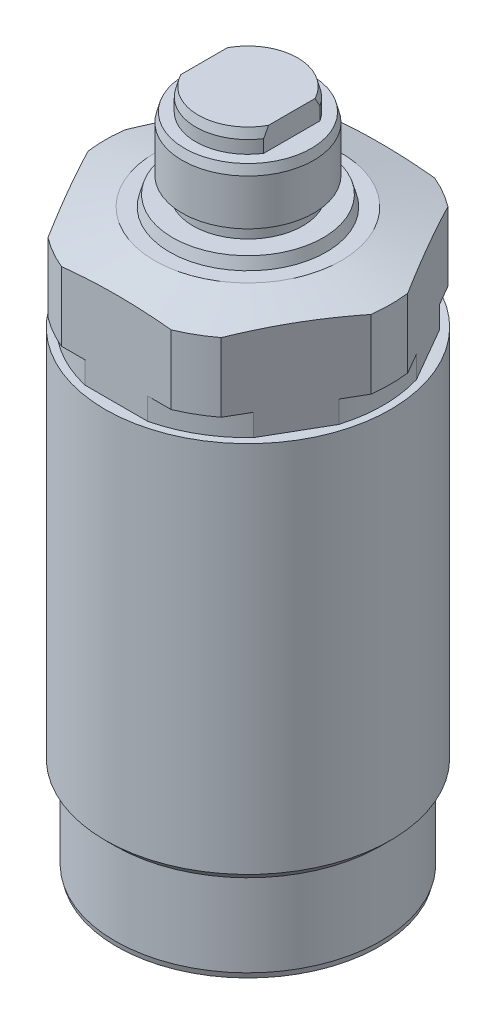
ISO-10303-21;
HEADER;
FILE_DESCRIPTION(('STEP AP214'),'2;1');
FILE_NAME('part.step','',(''),(''),'','','');
FILE_SCHEMA(('AUTOMOTIVE_DESIGN { 1 0 10303 214 1 1 1 1 }'));
ENDSEC;
DATA;
#1=APPLICATION_CONTEXT('core data for automotive mechanical design processes');
#2=APPLICATION_PROTOCOL_DEFINITION('international standard','automotive_design',2000,#1);
#3=PRODUCT_CONTEXT('',#1,'mechanical');
#4=PRODUCT('Part','Part','',(#3));
#5=PRODUCT_RELATED_PRODUCT_CATEGORY('part','',(#4));
#6=PRODUCT_DEFINITION_FORMATION('','',#4);
#7=PRODUCT_DEFINITION_CONTEXT('part definition',#1,'design');
#8=PRODUCT_DEFINITION('design','',#6,#7);
#9=PRODUCT_DEFINITION_SHAPE('','',#8);
#10=(LENGTH_UNIT() NAMED_UNIT(*) SI_UNIT(.MILLI.,.METRE.));
#11=(NAMED_UNIT(*) PLANE_ANGLE_UNIT() SI_UNIT($,.RADIAN.));
#12=(NAMED_UNIT(*) SI_UNIT($,.STERADIAN.) SOLID_ANGLE_UNIT());
#13=UNCERTAINTY_MEASURE_WITH_UNIT(LENGTH_MEASURE(1.E-05),#10,'distance_accuracy_value','');
#14=(GEOMETRIC_REPRESENTATION_CONTEXT(3) GLOBAL_UNCERTAINTY_ASSIGNED_CONTEXT((#13)) GLOBAL_UNIT_ASSIGNED_CONTEXT((#10,
#11,#12)) REPRESENTATION_CONTEXT('',''));
#15=CARTESIAN_POINT('',(0.,0.,0.));
#16=DIRECTION('',(0.,0.,1.));
#17=DIRECTION('',(1.,0.,0.));
#18=AXIS2_PLACEMENT_3D('',#15,#16,#17);
#19=CARTESIAN_POINT('',(13056.8968965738,11084.648396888,0.));
#20=DIRECTION('',(0.,1.,0.));
#21=DIRECTION('',(0.,0.,1.));
#22=AXIS2_PLACEMENT_3D('',#19,#20,#21);
#23=CYLINDRICAL_SURFACE('',#22,4.74999975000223);
#24=DIRECTION('',(0.,1.,0.));
#25=VECTOR('',#24,1.);
#26=CARTESIAN_POINT('',(13052.8968965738,11084.648396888,-2.56173722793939));
#27=LINE('',#26,#25);
#28=CARTESIAN_POINT('',(13052.8968965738,11070.3282926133,-2.56173722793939));
#29=VERTEX_POINT('',#28);
#30=CARTESIAN_POINT('',(13052.8968965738,11069.1649588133,-2.56173722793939));
#31=VERTEX_POINT('',#30);
#32=EDGE_CURVE('E229',#29,#31,#27,.F.);
#33=ORIENTED_EDGE('',*,*,#32,.F.);
#34=CARTESIAN_POINT('',(13056.8968965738,11070.3282926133,0.));
#35=DIRECTION('',(0.,1.,0.));
#36=DIRECTION('',(0.,0.,1.));
#37=AXIS2_PLACEMENT_3D('',#34,#35,#36);
#38=CIRCLE('',#37,4.74999975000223);
#39=CARTESIAN_POINT('',(13060.8968965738,11070.3282926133,-2.56173722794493));
#40=VERTEX_POINT('',#39);
#41=EDGE_CURVE('E257',#40,#29,#38,.T.);
#42=ORIENTED_EDGE('',*,*,#41,.F.);
#43=DIRECTION('',(0.,1.,0.));
#44=VECTOR('',#43,1.);
#45=CARTESIAN_POINT('',(13060.8968965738,11084.648396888,-2.56173722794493));
#46=LINE('',#45,#44);
#47=CARTESIAN_POINT('',(13060.8968965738,11069.1649588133,-2.56173722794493));
#48=VERTEX_POINT('',#47);
#49=EDGE_CURVE('E251',#48,#40,#46,.T.);
#50=ORIENTED_EDGE('',*,*,#49,.F.);
#51=CARTESIAN_POINT('',(13056.8968965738,11069.1649588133,0.));
#52=DIRECTION('',(0.,1.,0.));
#53=DIRECTION('',(0.,0.,1.));
#54=AXIS2_PLACEMENT_3D('',#51,#52,#53);
#55=CIRCLE('',#54,4.74999975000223);
#56=EDGE_CURVE('E247',#48,#31,#55,.T.);
#57=ORIENTED_EDGE('',*,*,#56,.T.);
#58=EDGE_LOOP('',(#33,#42,#50,#57));
#59=FACE_BOUND('',#58,.T.);
#60=ADVANCED_FACE('F34',(#59),#23,.T.);
#61=CARTESIAN_POINT('',(13056.8968965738,11071.1616259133,0.));
#62=DIRECTION('',(0.,-1.,0.));
#63=DIRECTION('',(0.,0.,-1.));
#64=AXIS2_PLACEMENT_3D('',#61,#62,#63);
#65=CONICAL_SURFACE('',#64,4.52670876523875,0.261799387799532);
#66=CARTESIAN_POINT('',(13052.8968965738,11064.6062051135,4.84550926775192));
#67=CARTESIAN_POINT('',(13052.8968965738,11064.8012490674,4.77773691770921));
#68=CARTESIAN_POINT('',(13052.8968965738,11064.9961171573,4.70945745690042));
#69=CARTESIAN_POINT('',(13052.8968965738,11065.3854456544,4.57173346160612));
#70=CARTESIAN_POINT('',(13052.8968965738,11065.5799060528,4.50228890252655));
#71=CARTESIAN_POINT('',(13052.8968965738,11066.162807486,4.29190329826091));
#72=CARTESIAN_POINT('',(13052.8968965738,11066.5505395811,4.14898955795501));
#73=CARTESIAN_POINT('',(13052.8968965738,11067.3292687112,3.85401268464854));
#74=CARTESIAN_POINT('',(13052.8968965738,11067.7202259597,3.70184359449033));
#75=CARTESIAN_POINT('',(13052.8968965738,11068.3035993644,3.46614075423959));
#76=CARTESIAN_POINT('',(13052.8968965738,11068.4975237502,3.38634159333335));
#77=CARTESIAN_POINT('',(13052.8968965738,11068.8841002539,3.22372479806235));
#78=CARTESIAN_POINT('',(13052.8968965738,11069.0767524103,3.14090725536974));
#79=CARTESIAN_POINT('',(13052.8968965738,11069.4597857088,2.9718597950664));
#80=CARTESIAN_POINT('',(13052.8968965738,11069.6501723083,2.8856422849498));
#81=CARTESIAN_POINT('',(13052.8968965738,11070.0288426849,2.70859102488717));
#82=CARTESIAN_POINT('',(13052.8968965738,11070.2171260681,2.61775642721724));
#83=CARTESIAN_POINT('',(13052.8968965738,11070.5897606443,2.4306514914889));
#84=CARTESIAN_POINT('',(13052.8968965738,11070.7741272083,2.33441192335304));
#85=CARTESIAN_POINT('',(13052.8968965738,11071.1385762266,2.13418212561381));
#86=CARTESIAN_POINT('',(13052.8968965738,11071.3186603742,2.03019502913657));
#87=CARTESIAN_POINT('',(13052.8968965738,11071.6199482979,1.84367846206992));
#88=CARTESIAN_POINT('',(13052.8968965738,11071.7428353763,1.76388074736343));
#89=CARTESIAN_POINT('',(13052.8968965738,11071.9845077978,1.59672461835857));
#90=CARTESIAN_POINT('',(13052.8968965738,11072.1032653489,1.50932519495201));
#91=CARTESIAN_POINT('',(13052.8968965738,11072.2907364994,1.35888047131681));
#92=CARTESIAN_POINT('',(13052.8968965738,11072.36176258,1.29873136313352));
#93=CARTESIAN_POINT('',(13052.8968965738,11072.4996406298,1.17361973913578));
#94=CARTESIAN_POINT('',(13052.8968965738,11072.5664880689,1.1086521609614));
#95=CARTESIAN_POINT('',(13052.8968965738,11072.6935402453,0.973461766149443));
#96=CARTESIAN_POINT('',(13052.8968965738,11072.7537959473,0.903287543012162));
#97=CARTESIAN_POINT('',(13052.8968965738,11072.865275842,0.756196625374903));
#98=CARTESIAN_POINT('',(13052.8968965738,11072.9165255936,0.679299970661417));
#99=CARTESIAN_POINT('',(13052.8968965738,11072.9939814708,0.539056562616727));
#100=CARTESIAN_POINT('',(13052.8968965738,11073.0232323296,0.477418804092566));
#101=CARTESIAN_POINT('',(13052.8968965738,11073.0720107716,0.350393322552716));
#102=CARTESIAN_POINT('',(13052.8968965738,11073.0915518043,0.285010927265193));
#103=CARTESIAN_POINT('',(13052.8968965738,11073.118785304,0.151062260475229));
#104=CARTESIAN_POINT('',(13052.8968965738,11073.1263594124,0.0824710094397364));
#105=CARTESIAN_POINT('',(13052.8968965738,11073.1281230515,-0.0549156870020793));
#106=CARTESIAN_POINT('',(13052.8968965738,11073.1223087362,-0.123711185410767));
#107=CARTESIAN_POINT('',(13052.8968965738,11073.0995245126,-0.251600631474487));
#108=CARTESIAN_POINT('',(13052.8968965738,11073.0838393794,-0.310934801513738));
#109=CARTESIAN_POINT('',(13052.8968965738,11073.044176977,-0.426692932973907));
#110=CARTESIAN_POINT('',(13052.8968965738,11073.0201992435,-0.483116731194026));
#111=CARTESIAN_POINT('',(13052.8968965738,11072.9448839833,-0.634574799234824));
#112=CARTESIAN_POINT('',(13052.8968965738,11072.8866455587,-0.726140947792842));
#113=CARTESIAN_POINT('',(13052.8968965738,11072.7574884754,-0.899958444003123));
#114=CARTESIAN_POINT('',(13052.8968965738,11072.6865141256,-0.982166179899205));
#115=CARTESIAN_POINT('',(13052.8968965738,11072.5574008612,-1.11713349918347));
#116=CARTESIAN_POINT('',(13052.8968965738,11072.5011540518,-1.17174145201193));
#117=CARTESIAN_POINT('',(13052.8968965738,11072.3855368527,-1.27756327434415));
#118=CARTESIAN_POINT('',(13052.8968965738,11072.3261653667,-1.32877593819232));
#119=CARTESIAN_POINT('',(13052.8968965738,11072.1443404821,-1.47832703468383));
#120=CARTESIAN_POINT('',(13052.8968965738,11072.0183755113,-1.57238110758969));
#121=CARTESIAN_POINT('',(13052.8968965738,11071.7593083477,-1.75324073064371));
#122=CARTESIAN_POINT('',(13052.8968965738,11071.6261403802,-1.83994969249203));
#123=CARTESIAN_POINT('',(13052.8968965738,11071.3560748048,-2.0069250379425));
#124=CARTESIAN_POINT('',(13052.8968965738,11071.2191819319,-2.08719913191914));
#125=CARTESIAN_POINT('',(13052.8968965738,11070.9475149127,-2.24012044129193));
#126=CARTESIAN_POINT('',(13052.8968965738,11070.8128349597,-2.31293643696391));
#127=CARTESIAN_POINT('',(13052.8968965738,11070.541556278,-2.45491384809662));
#128=CARTESIAN_POINT('',(13052.8968965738,11070.4049573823,-2.52407494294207));
#129=CARTESIAN_POINT('',(13052.8968965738,11069.9928648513,-2.72716116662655));
#130=CARTESIAN_POINT('',(13052.8968965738,11069.7151793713,-2.85663227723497));
#131=CARTESIAN_POINT('',(13052.8968965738,11069.1553996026,-3.10756323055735));
#132=CARTESIAN_POINT('',(13052.8968965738,11068.8732957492,-3.22900143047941));
#133=CARTESIAN_POINT('',(13052.8968965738,11068.3065608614,-3.46562246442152));
#134=CARTESIAN_POINT('',(13052.8968965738,11068.0219304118,-3.58080670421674));
#135=CARTESIAN_POINT('',(13052.8968965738,11067.477158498,-3.79596909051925));
#136=CARTESIAN_POINT('',(13052.8968965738,11067.2171828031,-3.89636920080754));
#137=CARTESIAN_POINT('',(13052.8968965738,11066.6960039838,-4.09398177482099));
#138=CARTESIAN_POINT('',(13052.8968965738,11066.4348007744,-4.19119401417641));
#139=CARTESIAN_POINT('',(13052.8968965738,11065.9127881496,-4.38249735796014));
#140=CARTESIAN_POINT('',(13052.8968965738,11065.6519836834,-4.47660200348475));
#141=CARTESIAN_POINT('',(13052.8968965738,11065.129623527,-4.66260577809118));
#142=CARTESIAN_POINT('',(13052.8968965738,11064.8680679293,-4.754505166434));
#143=CARTESIAN_POINT('',(13052.8968965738,11064.6062051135,-4.84550926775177));
#144=B_SPLINE_CURVE_WITH_KNOTS('',3,(#66,#67,#68,#69,#70,#71,#72,#73,#74,#75,#76,#77,#78,#79,
#80,#81,#82,#83,#84,#85,#86,#87,#88,#89,#90,#91,#92,#93,#94,#95,#96,#97,#98,#99,#100,#101,#102,
#103,#104,#105,#106,#107,#108,#109,#110,#111,#112,#113,#114,#115,#116,#117,#118,#119,#120,#121,
#122,#123,#124,#125,#126,#127,#128,#129,#130,#131,#132,#133,#134,#135,#136,#137,#138,#139,#140,
#141,#142,#143),.UNSPECIFIED.,.F.,.F.,(4,2,2,2,2,2,2,2,2,2,2,2,2,2,2,2,2,2,2,2,2,2,2,2,2,2,2,2,
2,2,2,2,2,2,2,2,2,2,4),(0.,0.619448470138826,1.2389100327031,2.47856056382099,3.73702933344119,
4.36611329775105,4.99517817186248,5.62212828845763,6.24919393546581,6.87299413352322,
7.49654341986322,7.93595391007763,8.37790248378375,8.65696518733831,8.93632534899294,
9.21334481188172,9.48956493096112,9.69361642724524,9.89738449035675,10.1031555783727,
10.3089857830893,10.4923848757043,10.675794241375,10.9994522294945,11.3245616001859,
11.5595944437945,11.7947103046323,12.2657788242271,12.7423042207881,13.2182498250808,
13.6774956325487,14.1367816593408,15.0557090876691,15.9770191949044,16.8981213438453,
17.7341646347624,18.5702666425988,19.4020447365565,20.2337245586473),.UNSPECIFIED.);
#145=CARTESIAN_POINT('',(13052.8968965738,11070.3282926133,2.56173722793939));
#146=VERTEX_POINT('',#145);
#147=CARTESIAN_POINT('',(13052.8968965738,11071.1616259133,2.11921972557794));
#148=VERTEX_POINT('',#147);
#149=EDGE_CURVE('E48',#146,#148,#144,.T.);
#150=ORIENTED_EDGE('',*,*,#149,.F.);
#151=CARTESIAN_POINT('',(13060.8968965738,11070.3282926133,2.56173722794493));
#152=VERTEX_POINT('',#151);
#153=EDGE_CURVE('E448',#146,#152,#38,.T.);
#154=ORIENTED_EDGE('',*,*,#153,.T.);
#155=CARTESIAN_POINT('',(13060.8968965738,11064.6062051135,-4.84550926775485));
#156=CARTESIAN_POINT('',(13060.8968965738,11064.8012490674,-4.77773691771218));
#157=CARTESIAN_POINT('',(13060.8968965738,11064.9961171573,-4.70945745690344));
#158=CARTESIAN_POINT('',(13060.8968965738,11065.3854456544,-4.57173346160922));
#159=CARTESIAN_POINT('',(13060.8968965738,11065.5799060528,-4.5022889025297));
#160=CARTESIAN_POINT('',(13060.8968965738,11066.162807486,-4.29190329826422));
#161=CARTESIAN_POINT('',(13060.8968965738,11066.5505395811,-4.14898955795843));
#162=CARTESIAN_POINT('',(13060.8968965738,11067.3292687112,-3.85401268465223));
#163=CARTESIAN_POINT('',(13060.8968965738,11067.7202259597,-3.70184359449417));
#164=CARTESIAN_POINT('',(13060.8968965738,11068.3035993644,-3.46614075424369));
#165=CARTESIAN_POINT('',(13060.8968965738,11068.4975237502,-3.38634159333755));
#166=CARTESIAN_POINT('',(13060.8968965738,11068.8841002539,-3.22372479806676));
#167=CARTESIAN_POINT('',(13060.8968965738,11069.0767524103,-3.14090725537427));
#168=CARTESIAN_POINT('',(13060.8968965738,11069.4597857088,-2.97185979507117));
#169=CARTESIAN_POINT('',(13060.8968965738,11069.6501723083,-2.88564228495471));
#170=CARTESIAN_POINT('',(13060.8968965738,11070.0288426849,-2.7085910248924));
#171=CARTESIAN_POINT('',(13060.8968965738,11070.2171260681,-2.61775642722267));
#172=CARTESIAN_POINT('',(13060.8968965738,11070.5897606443,-2.43065149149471));
#173=CARTESIAN_POINT('',(13060.8968965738,11070.7741272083,-2.33441192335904));
#174=CARTESIAN_POINT('',(13060.8968965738,11071.1385762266,-2.13418212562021));
#175=CARTESIAN_POINT('',(13060.8968965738,11071.3186603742,-2.03019502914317));
#176=CARTESIAN_POINT('',(13060.8968965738,11071.6199482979,-1.84367846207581));
#177=CARTESIAN_POINT('',(13060.8968965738,11071.7428353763,-1.76388074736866));
#178=CARTESIAN_POINT('',(13060.8968965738,11071.9845077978,-1.59672461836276));
#179=CARTESIAN_POINT('',(13060.8968965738,11072.1032653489,-1.50932519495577));
#180=CARTESIAN_POINT('',(13060.8968965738,11072.2907364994,-1.3588804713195));
#181=CARTESIAN_POINT('',(13060.8968965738,11072.36176258,-1.29873136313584));
#182=CARTESIAN_POINT('',(13060.8968965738,11072.4996406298,-1.17361973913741));
#183=CARTESIAN_POINT('',(13060.8968965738,11072.566488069,-1.10865216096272));
#184=CARTESIAN_POINT('',(13060.8968965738,11072.6935402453,-0.973461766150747));
#185=CARTESIAN_POINT('',(13060.8968965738,11072.7537959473,-0.903287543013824));
#186=CARTESIAN_POINT('',(13060.8968965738,11072.8652758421,-0.756196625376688));
#187=CARTESIAN_POINT('',(13060.8968965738,11072.9165255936,-0.679299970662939));
#188=CARTESIAN_POINT('',(13060.8968965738,11072.9939814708,-0.539056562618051));
#189=CARTESIAN_POINT('',(13060.8968965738,11073.0232323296,-0.477418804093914));
#190=CARTESIAN_POINT('',(13060.8968965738,11073.0720107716,-0.350393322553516));
#191=CARTESIAN_POINT('',(13060.8968965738,11073.0915518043,-0.285010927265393));
#192=CARTESIAN_POINT('',(13060.8968965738,11073.118785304,-0.151062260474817));
#193=CARTESIAN_POINT('',(13060.8968965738,11073.1263594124,-0.0824710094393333));
#194=CARTESIAN_POINT('',(13060.8968965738,11073.1281230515,0.0549156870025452));
#195=CARTESIAN_POINT('',(13060.8968965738,11073.1223087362,0.123711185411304));
#196=CARTESIAN_POINT('',(13060.8968965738,11073.0995245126,0.251600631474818));
#197=CARTESIAN_POINT('',(13060.8968965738,11073.0838393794,0.310934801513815));
#198=CARTESIAN_POINT('',(13060.8968965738,11073.0441769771,0.426692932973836));
#199=CARTESIAN_POINT('',(13060.8968965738,11073.0201992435,0.48311673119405));
#200=CARTESIAN_POINT('',(13060.8968965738,11072.9448839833,0.634574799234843));
#201=CARTESIAN_POINT('',(13060.8968965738,11072.8866455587,0.726140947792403));
#202=CARTESIAN_POINT('',(13060.8968965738,11072.7574884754,0.899958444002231));
#203=CARTESIAN_POINT('',(13060.8968965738,11072.6865141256,0.982166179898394));
#204=CARTESIAN_POINT('',(13060.8968965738,11072.5574008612,1.11713349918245));
#205=CARTESIAN_POINT('',(13060.8968965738,11072.5011540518,1.17174145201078));
#206=CARTESIAN_POINT('',(13060.8968965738,11072.3855368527,1.27756327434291));
#207=CARTESIAN_POINT('',(13060.8968965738,11072.3261653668,1.32877593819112));
#208=CARTESIAN_POINT('',(13060.8968965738,11072.1443404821,1.47832703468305));
#209=CARTESIAN_POINT('',(13060.8968965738,11072.0183755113,1.57238110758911));
#210=CARTESIAN_POINT('',(13060.8968965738,11071.7593083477,1.75324073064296));
#211=CARTESIAN_POINT('',(13060.8968965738,11071.6261403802,1.83994969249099));
#212=CARTESIAN_POINT('',(13060.8968965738,11071.3560748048,2.00692503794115));
#213=CARTESIAN_POINT('',(13060.8968965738,11071.2191819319,2.08719913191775));
#214=CARTESIAN_POINT('',(13060.8968965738,11070.9475149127,2.24012044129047));
#215=CARTESIAN_POINT('',(13060.8968965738,11070.8128349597,2.31293643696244));
#216=CARTESIAN_POINT('',(13060.8968965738,11070.541556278,2.45491384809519));
#217=CARTESIAN_POINT('',(13060.8968965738,11070.4049573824,2.52407494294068));
#218=CARTESIAN_POINT('',(13060.8968965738,11069.9928648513,2.72716116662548));
#219=CARTESIAN_POINT('',(13060.8968965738,11069.7151793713,2.85663227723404));
#220=CARTESIAN_POINT('',(13060.8968965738,11069.1553996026,3.10756323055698));
#221=CARTESIAN_POINT('',(13060.8968965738,11068.8732957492,3.22900143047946));
#222=CARTESIAN_POINT('',(13060.8968965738,11068.3065608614,3.4656224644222));
#223=CARTESIAN_POINT('',(13060.8968965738,11068.0219304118,3.58080670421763));
#224=CARTESIAN_POINT('',(13060.8968965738,11067.477158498,3.79596909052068));
#225=CARTESIAN_POINT('',(13060.8968965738,11067.2171828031,3.89636920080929));
#226=CARTESIAN_POINT('',(13060.8968965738,11066.6960039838,4.09398177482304));
#227=CARTESIAN_POINT('',(13060.8968965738,11066.4348007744,4.19119401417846));
#228=CARTESIAN_POINT('',(13060.8968965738,11065.9127881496,4.38249735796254));
#229=CARTESIAN_POINT('',(13060.8968965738,11065.6519836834,4.4766020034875));
#230=CARTESIAN_POINT('',(13060.8968965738,11065.129623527,4.66260577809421));
#231=CARTESIAN_POINT('',(13060.8968965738,11064.8680679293,4.75450516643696));
#232=CARTESIAN_POINT('',(13060.8968965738,11064.6062051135,4.8455092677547));
#233=B_SPLINE_CURVE_WITH_KNOTS('',3,(#155,#156,#157,#158,#159,#160,#161,#162,#163,#164,#165,
#166,#167,#168,#169,#170,#171,#172,#173,#174,#175,#176,#177,#178,#179,#180,#181,#182,#183,#184,
#185,#186,#187,#188,#189,#190,#191,#192,#193,#194,#195,#196,#197,#198,#199,#200,#201,#202,#203,
#204,#205,#206,#207,#208,#209,#210,#211,#212,#213,#214,#215,#216,#217,#218,#219,#220,#221,#222,
#223,#224,#225,#226,#227,#228,#229,#230,#231,#232),.UNSPECIFIED.,.F.,.F.,(4,2,2,2,2,2,2,2,2,2,2,
2,2,2,2,2,2,2,2,2,2,2,2,2,2,2,2,2,2,2,2,2,2,2,2,2,2,2,4),(0.,0.619448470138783,1.23891003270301,
2.47856056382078,3.73702933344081,4.36611329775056,4.99517817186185,5.62212828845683,
6.24919393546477,6.87299413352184,7.4965434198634,7.93595391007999,8.37790248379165,
8.65696518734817,8.93632534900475,9.21334481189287,9.48956493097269,9.69361642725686,
9.89738449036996,10.1031555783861,10.3089857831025,10.492384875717,10.6757942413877,
10.9994522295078,11.3245616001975,11.5595944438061,11.7947103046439,12.2657788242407,
12.7423042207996,13.2182498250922,13.6774956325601,14.1367816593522,15.0557090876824,
15.9770191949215,16.8981213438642,17.7341646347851,18.5702666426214,19.4020447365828,
20.2337245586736),.UNSPECIFIED.);
#234=CARTESIAN_POINT('',(13060.8968965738,11071.1616259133,2.11921972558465));
#235=VERTEX_POINT('',#234);
#236=EDGE_CURVE('E371',#235,#152,#233,.T.);
#237=ORIENTED_EDGE('',*,*,#236,.F.);
#238=CARTESIAN_POINT('',(13056.8968965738,11071.1616259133,0.));
#239=DIRECTION('',(0.,1.,0.));
#240=DIRECTION('',(0.,0.,1.));
#241=AXIS2_PLACEMENT_3D('',#238,#239,#240);
#242=CIRCLE('',#241,4.52670876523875);
#243=EDGE_CURVE('E571',#148,#235,#242,.T.);
#244=ORIENTED_EDGE('',*,*,#243,.F.);
#245=EDGE_LOOP('',(#150,#154,#237,#244));
#246=FACE_BOUND('',#245,.T.);
#247=ADVANCED_FACE('F367',(#246),#65,.T.);
#248=CARTESIAN_POINT('',(13056.8968965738,11084.648396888,0.));
#249=DIRECTION('',(0.,1.,0.));
#250=DIRECTION('',(0.,0.,1.));
#251=AXIS2_PLACEMENT_3D('',#248,#249,#250);
#252=CYLINDRICAL_SURFACE('',#251,12.3333327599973);
#253=CARTESIAN_POINT('',(13056.8968965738,11054.1649595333,0.));
#254=DIRECTION('',(0.,1.,0.));
#255=DIRECTION('',(0.,0.,1.));
#256=AXIS2_PLACEMENT_3D('',#253,#254,#255);
#257=CIRCLE('',#256,12.3333327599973);
#258=CARTESIAN_POINT('',(13065.8652020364,11054.1649595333,-8.4664392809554));
#259=VERTEX_POINT('',#258);
#260=CARTESIAN_POINT('',(13059.7448953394,11054.1649595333,-12.0000000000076));
#261=VERTEX_POINT('',#260);
#262=EDGE_CURVE('E614',#259,#261,#257,.T.);
#263=ORIENTED_EDGE('',*,*,#262,.F.);
#264=DIRECTION('',(0.,1.,0.));
#265=VECTOR('',#264,1.);
#266=CARTESIAN_POINT('',(13065.8652020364,11084.648396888,-8.46643928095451));
#267=LINE('',#266,#265);
#268=CARTESIAN_POINT('',(13065.8652020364,11052.1649595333,-8.46643928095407));
#269=VERTEX_POINT('',#268);
#270=EDGE_CURVE('E566',#259,#269,#267,.F.);
#271=ORIENTED_EDGE('',*,*,#270,.T.);
#272=CARTESIAN_POINT('',(13056.8968965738,11052.1649595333,0.));
#273=DIRECTION('',(0.,1.,0.));
#274=DIRECTION('',(0.,0.,1.));
#275=AXIS2_PLACEMENT_3D('',#272,#273,#274);
#276=CIRCLE('',#275,12.3333327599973);
#277=CARTESIAN_POINT('',(13059.7448953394,11052.1649595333,-12.0000000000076));
#278=VERTEX_POINT('',#277);
#279=EDGE_CURVE('E638',#269,#278,#276,.T.);
#280=ORIENTED_EDGE('',*,*,#279,.T.);
#281=DIRECTION('',(0.,1.,0.));
#282=VECTOR('',#281,1.);
#283=CARTESIAN_POINT('',(13059.7448953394,11084.648396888,-12.0000000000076));
#284=LINE('',#283,#282);
#285=EDGE_CURVE('E547',#278,#261,#284,.T.);
#286=ORIENTED_EDGE('',*,*,#285,.T.);
#287=EDGE_LOOP('',(#263,#271,#280,#286));
#288=FACE_BOUND('',#287,.T.);
#289=ADVANCED_FACE('F436',(#288),#252,.T.);
#290=CARTESIAN_POINT('',(13068.713200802,11052.1649595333,3.53356071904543));
#291=VERTEX_POINT('',#290);
#292=CARTESIAN_POINT('',(13068.713200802,11052.1649595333,-3.53356071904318));
#293=VERTEX_POINT('',#292);
#294=EDGE_CURVE('E301',#291,#293,#276,.T.);
#295=ORIENTED_EDGE('',*,*,#294,.T.);
#296=DIRECTION('',(0.,1.,0.));
#297=VECTOR('',#296,1.);
#298=CARTESIAN_POINT('',(13068.713200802,11084.648396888,-3.53356071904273));
#299=LINE('',#298,#297);
#300=CARTESIAN_POINT('',(13068.713200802,11054.1649595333,-3.53356071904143));
#301=VERTEX_POINT('',#300);
#302=EDGE_CURVE('E563',#293,#301,#299,.T.);
#303=ORIENTED_EDGE('',*,*,#302,.T.);
#304=CARTESIAN_POINT('',(13068.713200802,11054.1649595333,3.53356071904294));
#305=VERTEX_POINT('',#304);
#306=EDGE_CURVE('E296',#305,#301,#257,.T.);
#307=ORIENTED_EDGE('',*,*,#306,.F.);
#308=DIRECTION('',(0.,1.,0.));
#309=VECTOR('',#308,1.);
#310=CARTESIAN_POINT('',(13068.713200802,11084.648396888,3.53356071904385));
#311=LINE('',#310,#309);
#312=EDGE_CURVE('E486',#305,#291,#311,.F.);
#313=ORIENTED_EDGE('',*,*,#312,.T.);
#314=EDGE_LOOP('',(#295,#303,#307,#313));
#315=FACE_BOUND('',#314,.T.);
#316=ADVANCED_FACE('F631',(#315),#252,.T.);
#317=CARTESIAN_POINT('',(13054.0488978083,11054.1649595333,-12.0000000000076));
#318=VERTEX_POINT('',#317);
#319=CARTESIAN_POINT('',(13047.9285911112,11054.1649595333,-8.46643928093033));
#320=VERTEX_POINT('',#319);
#321=EDGE_CURVE('E609',#318,#320,#257,.T.);
#322=ORIENTED_EDGE('',*,*,#321,.F.);
#323=DIRECTION('',(0.,1.,0.));
#324=VECTOR('',#323,1.);
#325=CARTESIAN_POINT('',(13054.0488978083,11084.648396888,-12.0000000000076));
#326=LINE('',#325,#324);
#327=CARTESIAN_POINT('',(13054.0488978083,11052.1649595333,-12.0000000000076));
#328=VERTEX_POINT('',#327);
#329=EDGE_CURVE('E550',#318,#328,#326,.F.);
#330=ORIENTED_EDGE('',*,*,#329,.T.);
#331=CARTESIAN_POINT('',(13047.9285911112,11052.1649595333,-8.46643928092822));
#332=VERTEX_POINT('',#331);
#333=EDGE_CURVE('E641',#328,#332,#276,.T.);
#334=ORIENTED_EDGE('',*,*,#333,.T.);
#335=DIRECTION('',(0.,1.,0.));
#336=VECTOR('',#335,1.);
#337=CARTESIAN_POINT('',(13047.9285911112,11084.648396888,-8.46643928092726));
#338=LINE('',#337,#336);
#339=EDGE_CURVE('E531',#332,#320,#338,.T.);
#340=ORIENTED_EDGE('',*,*,#339,.T.);
#341=EDGE_LOOP('',(#322,#330,#334,#340));
#342=FACE_BOUND('',#341,.T.);
#343=ADVANCED_FACE('F675',(#342),#252,.T.);
#344=CARTESIAN_POINT('',(13045.0805923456,11054.1649595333,-3.53356071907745));
#345=VERTEX_POINT('',#344);
#346=CARTESIAN_POINT('',(13045.0805923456,11054.1649595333,3.53356071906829));
#347=VERTEX_POINT('',#346);
#348=EDGE_CURVE('E607',#345,#347,#257,.T.);
#349=ORIENTED_EDGE('',*,*,#348,.F.);
#350=DIRECTION('',(0.,1.,0.));
#351=VECTOR('',#350,1.);
#352=CARTESIAN_POINT('',(13045.0805923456,11084.648396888,-3.53356071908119));
#353=LINE('',#352,#351);
#354=CARTESIAN_POINT('',(13045.0805923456,11052.1649595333,-3.53356071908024));
#355=VERTEX_POINT('',#354);
#356=EDGE_CURVE('E534',#345,#355,#353,.F.);
#357=ORIENTED_EDGE('',*,*,#356,.T.);
#358=CARTESIAN_POINT('',(13045.0805923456,11052.1649595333,3.53356071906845));
#359=VERTEX_POINT('',#358);
#360=EDGE_CURVE('E643',#355,#359,#276,.T.);
#361=ORIENTED_EDGE('',*,*,#360,.T.);
#362=DIRECTION('',(0.,1.,0.));
#363=VECTOR('',#362,1.);
#364=CARTESIAN_POINT('',(13045.0805923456,11084.648396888,3.53356071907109));
#365=LINE('',#364,#363);
#366=EDGE_CURVE('E515',#359,#347,#365,.T.);
#367=ORIENTED_EDGE('',*,*,#366,.T.);
#368=EDGE_LOOP('',(#349,#357,#361,#367));
#369=FACE_BOUND('',#368,.T.);
#370=ADVANCED_FACE('F674',(#369),#252,.T.);
#371=CARTESIAN_POINT('',(13047.9285911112,11054.1649595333,8.46643928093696));
#372=VERTEX_POINT('',#371);
#373=CARTESIAN_POINT('',(13054.0488978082,11054.1649595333,12.0000000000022));
#374=VERTEX_POINT('',#373);
#375=EDGE_CURVE('E290',#372,#374,#257,.T.);
#376=ORIENTED_EDGE('',*,*,#375,.F.);
#377=DIRECTION('',(0.,1.,0.));
#378=VECTOR('',#377,1.);
#379=CARTESIAN_POINT('',(13047.9285911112,11084.648396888,8.4664392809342));
#380=LINE('',#379,#378);
#381=CARTESIAN_POINT('',(13047.9285911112,11052.1649595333,8.46643928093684));
#382=VERTEX_POINT('',#381);
#383=EDGE_CURVE('E518',#372,#382,#380,.F.);
#384=ORIENTED_EDGE('',*,*,#383,.T.);
#385=CARTESIAN_POINT('',(13054.0488978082,11052.1649595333,12.0000000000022));
#386=VERTEX_POINT('',#385);
#387=EDGE_CURVE('E295',#382,#386,#276,.T.);
#388=ORIENTED_EDGE('',*,*,#387,.T.);
#389=DIRECTION('',(0.,1.,0.));
#390=VECTOR('',#389,1.);
#391=CARTESIAN_POINT('',(13054.0488978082,11084.648396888,12.0000000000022));
#392=LINE('',#391,#390);
#393=EDGE_CURVE('E499',#386,#374,#392,.T.);
#394=ORIENTED_EDGE('',*,*,#393,.T.);
#395=EDGE_LOOP('',(#376,#384,#388,#394));
#396=FACE_BOUND('',#395,.T.);
#397=ADVANCED_FACE('F650',(#396),#252,.T.);
#398=CARTESIAN_POINT('',(13059.7448953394,11054.1649595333,12.0000000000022));
#399=VERTEX_POINT('',#398);
#400=CARTESIAN_POINT('',(13065.8652020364,11054.1649595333,8.46643928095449));
#401=VERTEX_POINT('',#400);
#402=EDGE_CURVE('E292',#399,#401,#257,.T.);
#403=ORIENTED_EDGE('',*,*,#402,.F.);
#404=DIRECTION('',(0.,1.,0.));
#405=VECTOR('',#404,1.);
#406=CARTESIAN_POINT('',(13059.7448953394,11084.648396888,12.0000000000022));
#407=LINE('',#406,#405);
#408=CARTESIAN_POINT('',(13059.7448953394,11052.1649595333,12.0000000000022));
#409=VERTEX_POINT('',#408);
#410=EDGE_CURVE('E502',#399,#409,#407,.F.);
#411=ORIENTED_EDGE('',*,*,#410,.T.);
#412=CARTESIAN_POINT('',(13065.8652020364,11052.1649595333,8.4664392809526));
#413=VERTEX_POINT('',#412);
#414=EDGE_CURVE('E297',#409,#413,#276,.T.);
#415=ORIENTED_EDGE('',*,*,#414,.T.);
#416=DIRECTION('',(0.,1.,0.));
#417=VECTOR('',#416,1.);
#418=CARTESIAN_POINT('',(13065.8652020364,11084.648396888,8.46643928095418));
#419=LINE('',#418,#417);
#420=EDGE_CURVE('E483',#413,#401,#419,.T.);
#421=ORIENTED_EDGE('',*,*,#420,.T.);
#422=EDGE_LOOP('',(#403,#411,#415,#421));
#423=FACE_BOUND('',#422,.T.);
#424=ADVANCED_FACE('F655',(#423),#252,.T.);
#425=CARTESIAN_POINT('',(13043.8968971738,11054.1649595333,0.));
#426=DIRECTION('',(0.,-1.,0.));
#427=DIRECTION('',(0.,0.,-1.));
#428=AXIS2_PLACEMENT_3D('',#425,#426,#427);
#429=PLANE('',#428);
#430=CARTESIAN_POINT('',(13056.8968965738,11054.1649595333,0.));
#431=DIRECTION('',(0.,1.,0.));
#432=DIRECTION('',(0.,0.,1.));
#433=AXIS2_PLACEMENT_3D('',#430,#431,#432);
#434=CIRCLE('',#433,12.9999993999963);
#435=CARTESIAN_POINT('',(13064.7892021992,11054.1649595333,-10.3301256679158));
#436=VERTEX_POINT('',#435);
#437=CARTESIAN_POINT('',(13061.8968950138,11054.1649595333,-12.0000000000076));
#438=VERTEX_POINT('',#437);
#439=EDGE_CURVE('E663',#436,#438,#434,.T.);
#440=ORIENTED_EDGE('',*,*,#439,.F.);
#441=DIRECTION('',(0.499999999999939,0.,0.866025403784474));
#442=VECTOR('',#441,1.);
#443=CARTESIAN_POINT('',(13064.0392015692,11054.1649595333,-11.6291648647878));
#444=LINE('',#443,#442);
#445=EDGE_CURVE('E562',#436,#259,#444,.T.);
#446=ORIENTED_EDGE('',*,*,#445,.T.);
#447=ORIENTED_EDGE('',*,*,#262,.T.);
#448=DIRECTION('',(1.,0.,0.));
#449=VECTOR('',#448,1.);
#450=CARTESIAN_POINT('',(13043.8968971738,11054.1649595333,-12.0000000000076));
#451=LINE('',#450,#449);
#452=EDGE_CURVE('E543',#261,#438,#451,.T.);
#453=ORIENTED_EDGE('',*,*,#452,.T.);
#454=EDGE_LOOP('',(#440,#446,#447,#453));
#455=FACE_BOUND('',#454,.T.);
#456=ADVANCED_FACE('F683',(#455),#429,.T.);
#457=ORIENTED_EDGE('',*,*,#306,.T.);
#458=CARTESIAN_POINT('',(13069.7892006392,11054.1649595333,-1.66987433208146));
#459=VERTEX_POINT('',#458);
#460=EDGE_CURVE('E559',#301,#459,#444,.T.);
#461=ORIENTED_EDGE('',*,*,#460,.T.);
#462=CARTESIAN_POINT('',(13069.7892006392,11054.1649595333,1.66987433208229));
#463=VERTEX_POINT('',#462);
#464=EDGE_CURVE('E291',#463,#459,#434,.T.);
#465=ORIENTED_EDGE('',*,*,#464,.F.);
#466=DIRECTION('',(-0.499999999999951,0.,0.866025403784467));
#467=VECTOR('',#466,1.);
#468=CARTESIAN_POINT('',(13064.0392015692,11054.1649595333,11.6291648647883));
#469=LINE('',#468,#467);
#470=EDGE_CURVE('E482',#463,#305,#469,.T.);
#471=ORIENTED_EDGE('',*,*,#470,.T.);
#472=EDGE_LOOP('',(#457,#461,#465,#471));
#473=FACE_BOUND('',#472,.T.);
#474=ADVANCED_FACE('F626',(#473),#429,.T.);
#475=CARTESIAN_POINT('',(13051.8968981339,11054.1649595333,-12.0000000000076));
#476=VERTEX_POINT('',#475);
#477=CARTESIAN_POINT('',(13049.0045909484,11054.1649595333,-10.3301256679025));
#478=VERTEX_POINT('',#477);
#479=EDGE_CURVE('E664',#476,#478,#434,.T.);
#480=ORIENTED_EDGE('',*,*,#479,.F.);
#481=EDGE_CURVE('E546',#476,#318,#451,.T.);
#482=ORIENTED_EDGE('',*,*,#481,.T.);
#483=ORIENTED_EDGE('',*,*,#321,.T.);
#484=DIRECTION('',(0.500000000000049,0.,-0.866025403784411));
#485=VECTOR('',#484,1.);
#486=CARTESIAN_POINT('',(13043.2545918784,11054.1649595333,-0.370835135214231));
#487=LINE('',#486,#485);
#488=EDGE_CURVE('E527',#320,#478,#487,.T.);
#489=ORIENTED_EDGE('',*,*,#488,.T.);
#490=EDGE_LOOP('',(#480,#482,#483,#489));
#491=FACE_BOUND('',#490,.T.);
#492=ADVANCED_FACE('F676',(#491),#429,.T.);
#493=CARTESIAN_POINT('',(13044.0045925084,11054.1649595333,-1.66987433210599));
#494=VERTEX_POINT('',#493);
#495=CARTESIAN_POINT('',(13044.0045925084,11054.1649595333,1.66987433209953));
#496=VERTEX_POINT('',#495);
#497=EDGE_CURVE('E666',#494,#496,#434,.T.);
#498=ORIENTED_EDGE('',*,*,#497,.F.);
#499=EDGE_CURVE('E530',#494,#345,#487,.T.);
#500=ORIENTED_EDGE('',*,*,#499,.T.);
#501=ORIENTED_EDGE('',*,*,#348,.T.);
#502=DIRECTION('',(-0.500000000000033,0.,-0.866025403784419));
#503=VECTOR('',#502,1.);
#504=CARTESIAN_POINT('',(13043.2545918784,11054.1649595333,0.370835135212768));
#505=LINE('',#504,#503);
#506=EDGE_CURVE('E511',#347,#496,#505,.T.);
#507=ORIENTED_EDGE('',*,*,#506,.T.);
#508=EDGE_LOOP('',(#498,#500,#501,#507));
#509=FACE_BOUND('',#508,.T.);
#510=ADVANCED_FACE('F673',(#509),#429,.T.);
#511=CARTESIAN_POINT('',(13049.0045909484,11054.1649595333,10.3301256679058));
#512=VERTEX_POINT('',#511);
#513=CARTESIAN_POINT('',(13051.8968981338,11054.1649595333,12.0000000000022));
#514=VERTEX_POINT('',#513);
#515=EDGE_CURVE('E285',#512,#514,#434,.T.);
#516=ORIENTED_EDGE('',*,*,#515,.F.);
#517=EDGE_CURVE('E514',#512,#372,#505,.T.);
#518=ORIENTED_EDGE('',*,*,#517,.T.);
#519=ORIENTED_EDGE('',*,*,#375,.T.);
#520=DIRECTION('',(-1.,0.,0.));
#521=VECTOR('',#520,1.);
#522=CARTESIAN_POINT('',(13043.8968971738,11054.1649595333,12.0000000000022));
#523=LINE('',#522,#521);
#524=EDGE_CURVE('E495',#374,#514,#523,.T.);
#525=ORIENTED_EDGE('',*,*,#524,.T.);
#526=EDGE_LOOP('',(#516,#518,#519,#525));
#527=FACE_BOUND('',#526,.T.);
#528=ADVANCED_FACE('F603',(#527),#429,.T.);
#529=CARTESIAN_POINT('',(13061.8968950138,11054.1649595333,12.0000000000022));
#530=VERTEX_POINT('',#529);
#531=CARTESIAN_POINT('',(13064.7892021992,11054.1649595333,10.3301256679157));
#532=VERTEX_POINT('',#531);
#533=EDGE_CURVE('E287',#530,#532,#434,.T.);
#534=ORIENTED_EDGE('',*,*,#533,.F.);
#535=EDGE_CURVE('E498',#530,#399,#523,.T.);
#536=ORIENTED_EDGE('',*,*,#535,.T.);
#537=ORIENTED_EDGE('',*,*,#402,.T.);
#538=EDGE_CURVE('E479',#401,#532,#469,.T.);
#539=ORIENTED_EDGE('',*,*,#538,.T.);
#540=EDGE_LOOP('',(#534,#536,#537,#539));
#541=FACE_BOUND('',#540,.T.);
#542=ADVANCED_FACE('F658',(#541),#429,.T.);
#543=CARTESIAN_POINT('',(13056.8968965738,11084.648396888,0.));
#544=DIRECTION('',(0.,1.,0.));
#545=DIRECTION('',(0.,0.,1.));
#546=AXIS2_PLACEMENT_3D('',#543,#544,#545);
#547=CYLINDRICAL_SURFACE('',#546,12.9999993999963);
#548=CARTESIAN_POINT('',(13056.8968965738,11060.4558547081,0.));
#549=DIRECTION('',(0.,1.,0.));
#550=DIRECTION('',(0.,0.,1.));
#551=AXIS2_PLACEMENT_3D('',#548,#549,#550);
#552=CIRCLE('',#551,12.9999993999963);
#553=CARTESIAN_POINT('',(13064.7892021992,11060.4558547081,-10.3301256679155));
#554=VERTEX_POINT('',#553);
#555=CARTESIAN_POINT('',(13061.8968950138,11060.4558547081,-12.0000000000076));
#556=VERTEX_POINT('',#555);
#557=EDGE_CURVE('E581',#554,#556,#552,.T.);
#558=ORIENTED_EDGE('',*,*,#557,.F.);
#559=DIRECTION('',(0.,1.,0.));
#560=VECTOR('',#559,1.);
#561=CARTESIAN_POINT('',(13064.7892021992,11084.648396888,-10.3301256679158));
#562=LINE('',#561,#560);
#563=EDGE_CURVE('E556',#554,#436,#562,.F.);
#564=ORIENTED_EDGE('',*,*,#563,.T.);
#565=ORIENTED_EDGE('',*,*,#439,.T.);
#566=DIRECTION('',(0.,1.,0.));
#567=VECTOR('',#566,1.);
#568=CARTESIAN_POINT('',(13061.8968950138,11084.648396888,-12.0000000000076));
#569=LINE('',#568,#567);
#570=EDGE_CURVE('E537',#438,#556,#569,.T.);
#571=ORIENTED_EDGE('',*,*,#570,.T.);
#572=EDGE_LOOP('',(#558,#564,#565,#571));
#573=FACE_BOUND('',#572,.T.);
#574=ADVANCED_FACE('F584',(#573),#547,.T.);
#575=ORIENTED_EDGE('',*,*,#464,.T.);
#576=DIRECTION('',(0.,1.,0.));
#577=VECTOR('',#576,1.);
#578=CARTESIAN_POINT('',(13069.7892006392,11084.648396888,-1.66987433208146));
#579=LINE('',#578,#577);
#580=CARTESIAN_POINT('',(13069.7892006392,11060.4558547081,-1.66987433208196));
#581=VERTEX_POINT('',#580);
#582=EDGE_CURVE('E553',#459,#581,#579,.T.);
#583=ORIENTED_EDGE('',*,*,#582,.T.);
#584=CARTESIAN_POINT('',(13069.7892006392,11060.4558547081,1.66987433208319));
#585=VERTEX_POINT('',#584);
#586=EDGE_CURVE('E286',#585,#581,#552,.T.);
#587=ORIENTED_EDGE('',*,*,#586,.F.);
#588=DIRECTION('',(0.,1.,0.));
#589=VECTOR('',#588,1.);
#590=CARTESIAN_POINT('',(13069.7892006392,11084.648396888,1.66987433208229));
#591=LINE('',#590,#589);
#592=EDGE_CURVE('E476',#585,#463,#591,.F.);
#593=ORIENTED_EDGE('',*,*,#592,.T.);
#594=EDGE_LOOP('',(#575,#583,#587,#593));
#595=FACE_BOUND('',#594,.T.);
#596=ADVANCED_FACE('F662',(#595),#547,.T.);
#597=CARTESIAN_POINT('',(13051.8968981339,11060.4558547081,-12.0000000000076));
#598=VERTEX_POINT('',#597);
#599=CARTESIAN_POINT('',(13049.0045909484,11060.4558547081,-10.3301256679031));
#600=VERTEX_POINT('',#599);
#601=EDGE_CURVE('E587',#598,#600,#552,.T.);
#602=ORIENTED_EDGE('',*,*,#601,.F.);
#603=DIRECTION('',(0.,1.,0.));
#604=VECTOR('',#603,1.);
#605=CARTESIAN_POINT('',(13051.8968981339,11084.648396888,-12.0000000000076));
#606=LINE('',#605,#604);
#607=EDGE_CURVE('E540',#598,#476,#606,.F.);
#608=ORIENTED_EDGE('',*,*,#607,.T.);
#609=ORIENTED_EDGE('',*,*,#479,.T.);
#610=DIRECTION('',(0.,1.,0.));
#611=VECTOR('',#610,1.);
#612=CARTESIAN_POINT('',(13049.0045909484,11084.648396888,-10.3301256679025));
#613=LINE('',#612,#611);
#614=EDGE_CURVE('E521',#478,#600,#613,.T.);
#615=ORIENTED_EDGE('',*,*,#614,.T.);
#616=EDGE_LOOP('',(#602,#608,#609,#615));
#617=FACE_BOUND('',#616,.T.);
#618=ADVANCED_FACE('F922',(#617),#547,.T.);
#619=CARTESIAN_POINT('',(13044.0045925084,11060.4558547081,-1.66987433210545));
#620=VERTEX_POINT('',#619);
#621=CARTESIAN_POINT('',(13044.0045925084,11060.4558547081,1.66987433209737));
#622=VERTEX_POINT('',#621);
#623=EDGE_CURVE('E589',#620,#622,#552,.T.);
#624=ORIENTED_EDGE('',*,*,#623,.F.);
#625=DIRECTION('',(0.,1.,0.));
#626=VECTOR('',#625,1.);
#627=CARTESIAN_POINT('',(13044.0045925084,11084.648396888,-1.66987433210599));
#628=LINE('',#627,#626);
#629=EDGE_CURVE('E524',#620,#494,#628,.F.);
#630=ORIENTED_EDGE('',*,*,#629,.T.);
#631=ORIENTED_EDGE('',*,*,#497,.T.);
#632=DIRECTION('',(0.,1.,0.));
#633=VECTOR('',#632,1.);
#634=CARTESIAN_POINT('',(13044.0045925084,11084.648396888,1.66987433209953));
#635=LINE('',#634,#633);
#636=EDGE_CURVE('E505',#496,#622,#635,.T.);
#637=ORIENTED_EDGE('',*,*,#636,.T.);
#638=EDGE_LOOP('',(#624,#630,#631,#637));
#639=FACE_BOUND('',#638,.T.);
#640=ADVANCED_FACE('F672',(#639),#547,.T.);
#641=CARTESIAN_POINT('',(13049.0045909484,11060.4558547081,10.3301256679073));
#642=VERTEX_POINT('',#641);
#643=CARTESIAN_POINT('',(13051.8968981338,11060.4558547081,12.0000000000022));
#644=VERTEX_POINT('',#643);
#645=EDGE_CURVE('E281',#642,#644,#552,.T.);
#646=ORIENTED_EDGE('',*,*,#645,.F.);
#647=DIRECTION('',(0.,1.,0.));
#648=VECTOR('',#647,1.);
#649=CARTESIAN_POINT('',(13049.0045909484,11084.648396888,10.3301256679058));
#650=LINE('',#649,#648);
#651=EDGE_CURVE('E508',#642,#512,#650,.F.);
#652=ORIENTED_EDGE('',*,*,#651,.T.);
#653=ORIENTED_EDGE('',*,*,#515,.T.);
#654=DIRECTION('',(0.,1.,0.));
#655=VECTOR('',#654,1.);
#656=CARTESIAN_POINT('',(13051.8968981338,11084.648396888,12.0000000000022));
#657=LINE('',#656,#655);
#658=EDGE_CURVE('E489',#514,#644,#657,.T.);
#659=ORIENTED_EDGE('',*,*,#658,.T.);
#660=EDGE_LOOP('',(#646,#652,#653,#659));
#661=FACE_BOUND('',#660,.T.);
#662=ADVANCED_FACE('F598',(#661),#547,.T.);
#663=CARTESIAN_POINT('',(13061.8968950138,11060.4558547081,12.0000000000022));
#664=VERTEX_POINT('',#663);
#665=CARTESIAN_POINT('',(13064.7892021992,11060.4558547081,10.3301256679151));
#666=VERTEX_POINT('',#665);
#667=EDGE_CURVE('E282',#664,#666,#552,.T.);
#668=ORIENTED_EDGE('',*,*,#667,.F.);
#669=DIRECTION('',(0.,1.,0.));
#670=VECTOR('',#669,1.);
#671=CARTESIAN_POINT('',(13061.8968950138,11084.648396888,12.0000000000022));
#672=LINE('',#671,#670);
#673=EDGE_CURVE('E492',#664,#530,#672,.F.);
#674=ORIENTED_EDGE('',*,*,#673,.T.);
#675=ORIENTED_EDGE('',*,*,#533,.T.);
#676=DIRECTION('',(0.,1.,0.));
#677=VECTOR('',#676,1.);
#678=CARTESIAN_POINT('',(13064.7892021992,11084.648396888,10.3301256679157));
#679=LINE('',#678,#677);
#680=EDGE_CURVE('E462',#532,#666,#679,.T.);
#681=ORIENTED_EDGE('',*,*,#680,.T.);
#682=EDGE_LOOP('',(#668,#674,#675,#681));
#683=FACE_BOUND('',#682,.T.);
#684=ADVANCED_FACE('F660',(#683),#547,.T.);
#685=CARTESIAN_POINT('',(13056.8968965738,11061.6616259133,0.));
#686=DIRECTION('',(0.,-1.,0.));
#687=DIRECTION('',(0.,0.,-1.));
#688=AXIS2_PLACEMENT_3D('',#685,#686,#687);
#689=CONICAL_SURFACE('',#688,8.49999999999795,1.30899693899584);
#690=CARTESIAN_POINT('',(13056.8968965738,11061.6616259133,0.));
#691=DIRECTION('',(0.,1.,0.));
#692=DIRECTION('',(0.,0.,1.));
#693=AXIS2_PLACEMENT_3D('',#690,#691,#692);
#694=CIRCLE('',#693,8.49999999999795);
#695=CARTESIAN_POINT('',(13056.8968965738,11061.6616259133,8.49999999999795));
#696=VERTEX_POINT('',#695);
#697=EDGE_CURVE('E278',#696,#696,#694,.T.);
#698=ORIENTED_EDGE('',*,*,#697,.F.);
#699=EDGE_LOOP('',(#698));
#700=FACE_BOUND('',#699,.T.);
#701=ORIENTED_EDGE('',*,*,#586,.T.);
#702=CARTESIAN_POINT('',(13069.7901708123,11060.4556547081,-1.66819394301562));
#703=CARTESIAN_POINT('',(13069.5821919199,11060.4985670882,-2.02842395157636));
#704=CARTESIAN_POINT('',(13069.3739655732,11060.5369163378,-2.38908256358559));
#705=CARTESIAN_POINT('',(13068.9570869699,11060.6035776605,-3.11113748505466));
#706=CARTESIAN_POINT('',(13068.7484346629,11060.6318884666,-3.47253388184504));
#707=CARTESIAN_POINT('',(13068.3314256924,11060.677485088,-4.19481460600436));
#708=CARTESIAN_POINT('',(13068.1230699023,11060.6948023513,-4.55569742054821));
#709=CARTESIAN_POINT('',(13067.7062098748,11060.717961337,-5.27772016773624));
#710=CARTESIAN_POINT('',(13067.497705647,11060.7238037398,-5.63886008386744));
#711=CARTESIAN_POINT('',(13067.0806971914,11060.7238037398,-6.36113991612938));
#712=CARTESIAN_POINT('',(13066.8721929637,11060.717961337,-6.72227983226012));
#713=CARTESIAN_POINT('',(13066.4553329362,11060.6948023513,-7.44430257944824));
#714=CARTESIAN_POINT('',(13066.2469771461,11060.677485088,-7.80518539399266));
#715=CARTESIAN_POINT('',(13065.8299681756,11060.6318884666,-8.52746611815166));
#716=CARTESIAN_POINT('',(13065.6213158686,11060.6035776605,-8.88886251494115));
#717=CARTESIAN_POINT('',(13065.2044372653,11060.5369163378,-9.61091743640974));
#718=CARTESIAN_POINT('',(13064.9962109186,11060.4985670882,-9.97157604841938));
#719=CARTESIAN_POINT('',(13064.7882320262,11060.4556547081,-10.3318060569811));
#720=B_SPLINE_CURVE_WITH_KNOTS('',3,(#702,#703,#704,#705,#706,#707,#708,#709,#710,#711,#712,
#713,#714,#715,#716,#717,#718,#719),.UNSPECIFIED.,.F.,.F.,(4,2,2,2,2,2,2,2,4),(0.,
1.25450724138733,2.50917275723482,3.76023282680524,5.01121872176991,6.26220461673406,
7.51326468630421,8.76793020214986,10.0224374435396),.UNSPECIFIED.);
#721=EDGE_CURVE('E418',#581,#554,#720,.T.);
#722=ORIENTED_EDGE('',*,*,#721,.T.);
#723=ORIENTED_EDGE('',*,*,#557,.T.);
#724=CARTESIAN_POINT('',(13038.663700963,11058.0904737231,-12.0000000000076));
#725=CARTESIAN_POINT('',(13039.2070654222,11058.2120588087,-12.0000000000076));
#726=CARTESIAN_POINT('',(13039.7507723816,11058.3321409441,-12.0000000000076));
#727=CARTESIAN_POINT('',(13040.8390393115,11058.5684881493,-12.0000000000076));
#728=CARTESIAN_POINT('',(13041.3835993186,11058.6847530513,-12.0000000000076));
#729=CARTESIAN_POINT('',(13042.4742401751,11058.9127582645,-12.0000000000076));
#730=CARTESIAN_POINT('',(13043.0203220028,11059.0244939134,-12.0000000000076));
#731=CARTESIAN_POINT('',(13044.1136292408,11059.2422194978,-12.0000000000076));
#732=CARTESIAN_POINT('',(13044.6608546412,11059.348209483,-12.0000000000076));
#733=CARTESIAN_POINT('',(13045.7521949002,11059.552244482,-12.0000000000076));
#734=CARTESIAN_POINT('',(13046.2962989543,11059.6503470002,-12.0000000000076));
#735=CARTESIAN_POINT('',(13047.386010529,11059.8378857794,-12.0000000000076));
#736=CARTESIAN_POINT('',(13047.9316180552,11059.9273220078,-12.0000000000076));
#737=CARTESIAN_POINT('',(13049.0244109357,11060.0954907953,-12.0000000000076));
#738=CARTESIAN_POINT('',(13049.5715960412,11060.174224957,-12.0000000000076));
#739=CARTESIAN_POINT('',(13050.6677041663,11060.3186537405,-12.0000000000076));
#740=CARTESIAN_POINT('',(13051.2166271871,11060.3843483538,-12.0000000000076));
#741=CARTESIAN_POINT('',(13052.3223716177,11060.5008184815,-12.0000000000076));
#742=CARTESIAN_POINT('',(13052.8792120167,11060.5514164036,-12.0000000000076));
#743=CARTESIAN_POINT('',(13053.9942720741,11060.6341893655,-12.0000000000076));
#744=CARTESIAN_POINT('',(13054.5524917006,11060.6663648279,-12.0000000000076));
#745=CARTESIAN_POINT('',(13055.6695012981,11060.71041539,-12.0000000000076));
#746=CARTESIAN_POINT('',(13056.2282909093,11060.7222994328,-12.0000000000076));
#747=CARTESIAN_POINT('',(13057.3459226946,11060.725038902,-12.0000000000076));
#748=CARTESIAN_POINT('',(13057.9047648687,11060.7158943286,-12.0000000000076));
#749=CARTESIAN_POINT('',(13059.0237963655,11060.6770894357,-12.0000000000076));
#750=CARTESIAN_POINT('',(13059.5839830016,11060.647353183,-12.0000000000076));
#751=CARTESIAN_POINT('',(13060.7030264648,11060.5690513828,-12.0000000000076));
#752=CARTESIAN_POINT('',(13061.2618832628,11060.5204854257,-12.0000000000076));
#753=CARTESIAN_POINT('',(13062.3782671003,11060.4069538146,-12.0000000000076));
#754=CARTESIAN_POINT('',(13062.9357930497,11060.3419776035,-12.0000000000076));
#755=CARTESIAN_POINT('',(13064.0490539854,11060.1983005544,-12.0000000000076));
#756=CARTESIAN_POINT('',(13064.6047889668,11060.1195996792,-12.0000000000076));
#757=CARTESIAN_POINT('',(13065.6828265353,11059.9557808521,-12.0000000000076));
#758=CARTESIAN_POINT('',(13066.2052248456,11059.8712866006,-12.0000000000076));
#759=CARTESIAN_POINT('',(13067.2486391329,11059.6941170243,-12.0000000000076));
#760=CARTESIAN_POINT('',(13067.7696550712,11059.6014414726,-12.0000000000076));
#761=CARTESIAN_POINT('',(13068.8105040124,11059.4094132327,-12.0000000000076));
#762=CARTESIAN_POINT('',(13069.3303368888,11059.3100598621,-12.0000000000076));
#763=CARTESIAN_POINT('',(13070.368924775,11059.1059146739,-12.0000000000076));
#764=CARTESIAN_POINT('',(13070.8876797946,11059.0011229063,-12.0000000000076));
#765=CARTESIAN_POINT('',(13071.9243939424,11058.7870634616,-12.0000000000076));
#766=CARTESIAN_POINT('',(13072.4423528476,11058.6777947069,-12.0000000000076));
#767=CARTESIAN_POINT('',(13073.4774841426,11058.4555879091,-12.0000000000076));
#768=CARTESIAN_POINT('',(13073.9946565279,11058.3426498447,-12.0000000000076));
#769=CARTESIAN_POINT('',(13075.5451006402,11057.9993270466,-12.0000000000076));
#770=CARTESIAN_POINT('',(13076.5773703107,11057.7644188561,-12.0000000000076));
#771=CARTESIAN_POINT('',(13078.62945542,11057.2886343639,-12.0000000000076));
#772=CARTESIAN_POINT('',(13079.6492907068,11057.0478431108,-12.0000000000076));
#773=CARTESIAN_POINT('',(13081.6875506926,11056.5602908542,-12.0000000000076));
#774=CARTESIAN_POINT('',(13082.7059753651,11056.3135297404,-12.0000000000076));
#775=CARTESIAN_POINT('',(13084.7404837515,11055.8158985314,-12.0000000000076));
#776=CARTESIAN_POINT('',(13085.7565688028,11055.5650338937,-12.0000000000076));
#777=CARTESIAN_POINT('',(13087.2800544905,11055.1862298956,-12.0000000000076));
#778=CARTESIAN_POINT('',(13087.7877678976,11055.059546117,-12.0000000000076));
#779=CARTESIAN_POINT('',(13088.8030088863,11054.805438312,-12.0000000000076));
#780=CARTESIAN_POINT('',(13089.3105364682,11054.6780142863,-12.0000000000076));
#781=CARTESIAN_POINT('',(13089.8179830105,11054.55026837,-12.0000000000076));
#782=B_SPLINE_CURVE_WITH_KNOTS('',3,(#724,#725,#726,#727,#728,#729,#730,#731,#732,#733,#734,
#735,#736,#737,#738,#739,#740,#741,#742,#743,#744,#745,#746,#747,#748,#749,#750,#751,#752,#753,
#754,#755,#756,#757,#758,#759,#760,#761,#762,#763,#764,#765,#766,#767,#768,#769,#770,#771,#772,
#773,#774,#775,#776,#777,#778,#779,#780,#781),.UNSPECIFIED.,.F.,.F.,(4,2,2,2,2,2,2,2,2,2,2,2,2,
2,2,2,2,2,2,2,2,2,2,2,2,2,2,2,4),(0.,1.67041131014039,3.34089597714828,5.01305870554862,
6.68520701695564,8.34378293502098,10.0023650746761,11.660698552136,13.3190330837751,
14.9961692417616,16.6732669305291,18.349625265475,20.0259835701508,21.7085567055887,
23.3911664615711,25.0748614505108,26.7585610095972,28.3460461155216,29.9335752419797,
31.5212668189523,33.1089437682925,34.6970050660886,36.2850755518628,39.4609989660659,
42.6046064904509,45.7482720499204,48.8880507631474,50.4578895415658,52.0277266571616),.UNSPECIFIED.);
#783=EDGE_CURVE('E412',#556,#598,#782,.F.);
#784=ORIENTED_EDGE('',*,*,#783,.T.);
#785=ORIENTED_EDGE('',*,*,#601,.T.);
#786=CARTESIAN_POINT('',(13049.0055611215,11060.4556547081,-10.3318060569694));
#787=CARTESIAN_POINT('',(13048.7975822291,11060.4985670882,-9.97157604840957));
#788=CARTESIAN_POINT('',(13048.5893558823,11060.5369163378,-9.61091743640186));
#789=CARTESIAN_POINT('',(13048.1724772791,11060.6035776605,-8.88886251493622));
#790=CARTESIAN_POINT('',(13047.9638249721,11060.6318884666,-8.52746611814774));
#791=CARTESIAN_POINT('',(13047.5468160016,11060.677485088,-7.80518539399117));
#792=CARTESIAN_POINT('',(13047.3384602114,11060.6948023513,-7.44430257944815));
#793=CARTESIAN_POINT('',(13046.921600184,11060.717961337,-6.72227983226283));
#794=CARTESIAN_POINT('',(13046.7130959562,11060.7238037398,-6.36113991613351));
#795=CARTESIAN_POINT('',(13046.2960875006,11060.7238037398,-5.63886008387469));
#796=CARTESIAN_POINT('',(13046.0875832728,11060.717961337,-5.27772016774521));
#797=CARTESIAN_POINT('',(13045.6707232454,11060.6948023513,-4.55569742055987));
#798=CARTESIAN_POINT('',(13045.4623674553,11060.677485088,-4.19481460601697));
#799=CARTESIAN_POINT('',(13045.0453584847,11060.6318884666,-3.47253388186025));
#800=CARTESIAN_POINT('',(13044.8367061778,11060.6035776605,-3.11113748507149));
#801=CARTESIAN_POINT('',(13044.4198275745,11060.5369163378,-2.38908256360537));
#802=CARTESIAN_POINT('',(13044.2116012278,11060.4985670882,-2.02842395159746));
#803=CARTESIAN_POINT('',(13044.0036223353,11060.4556547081,-1.6681939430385));
#804=B_SPLINE_CURVE_WITH_KNOTS('',3,(#786,#787,#788,#789,#790,#791,#792,#793,#794,#795,#796,
#797,#798,#799,#800,#801,#802,#803),.UNSPECIFIED.,.F.,.F.,(4,2,2,2,2,2,2,2,4),(0.,
1.25450724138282,2.50917275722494,3.76023282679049,5.01121872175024,6.2622046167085,
7.51326468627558,8.76793020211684,10.0224374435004),.UNSPECIFIED.);
#805=EDGE_CURVE('E406',#600,#620,#804,.T.);
#806=ORIENTED_EDGE('',*,*,#805,.T.);
#807=ORIENTED_EDGE('',*,*,#623,.T.);
#808=CARTESIAN_POINT('',(13044.0036223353,11060.4556547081,1.66819394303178));
#809=CARTESIAN_POINT('',(13044.2116012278,11060.4985670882,2.02842395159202));
#810=CARTESIAN_POINT('',(13044.4198275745,11060.5369163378,2.38908256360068));
#811=CARTESIAN_POINT('',(13044.8367061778,11060.6035776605,3.11113748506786));
#812=CARTESIAN_POINT('',(13045.0453584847,11060.6318884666,3.47253388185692));
#813=CARTESIAN_POINT('',(13045.4623674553,11060.677485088,4.19481460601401));
#814=CARTESIAN_POINT('',(13045.6707232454,11060.6948023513,4.55569742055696));
#815=CARTESIAN_POINT('',(13046.0875832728,11060.717961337,5.27772016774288));
#816=CARTESIAN_POINT('',(13046.2960875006,11060.7238037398,5.63886008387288));
#817=CARTESIAN_POINT('',(13046.7130959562,11060.7238037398,6.36113991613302));
#818=CARTESIAN_POINT('',(13046.921600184,11060.717961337,6.72227983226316));
#819=CARTESIAN_POINT('',(13047.3384602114,11060.6948023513,7.44430257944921));
#820=CARTESIAN_POINT('',(13047.5468160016,11060.677485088,7.80518539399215));
#821=CARTESIAN_POINT('',(13047.9638249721,11060.6318884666,8.52746611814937));
#822=CARTESIAN_POINT('',(13048.1724772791,11060.6035776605,8.88886251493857));
#823=CARTESIAN_POINT('',(13048.5893558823,11060.5369163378,9.61091743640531));
#824=CARTESIAN_POINT('',(13048.7975822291,11060.4985670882,9.97157604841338));
#825=CARTESIAN_POINT('',(13049.0055611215,11060.4556547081,10.331806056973));
#826=B_SPLINE_CURVE_WITH_KNOTS('',3,(#808,#809,#810,#811,#812,#813,#814,#815,#816,#817,#818,
#819,#820,#821,#822,#823,#824,#825),.UNSPECIFIED.,.F.,.F.,(4,2,2,2,2,2,2,2,4),(0.,
1.25450724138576,2.50917275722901,3.76023282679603,5.0112187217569,6.2622046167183,
7.51326468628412,8.76793020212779,10.0224374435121),.UNSPECIFIED.);
#827=EDGE_CURVE('E400',#622,#642,#826,.T.);
#828=ORIENTED_EDGE('',*,*,#827,.T.);
#829=ORIENTED_EDGE('',*,*,#645,.T.);
#830=CARTESIAN_POINT('',(13038.663700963,11058.0904737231,12.0000000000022));
#831=CARTESIAN_POINT('',(13039.2070654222,11058.2120588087,12.0000000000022));
#832=CARTESIAN_POINT('',(13039.7507723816,11058.3321409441,12.0000000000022));
#833=CARTESIAN_POINT('',(13040.8390393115,11058.5684881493,12.0000000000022));
#834=CARTESIAN_POINT('',(13041.3835993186,11058.6847530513,12.0000000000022));
#835=CARTESIAN_POINT('',(13042.4742401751,11058.9127582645,12.0000000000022));
#836=CARTESIAN_POINT('',(13043.0203220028,11059.0244939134,12.0000000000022));
#837=CARTESIAN_POINT('',(13044.1136292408,11059.2422194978,12.0000000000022));
#838=CARTESIAN_POINT('',(13044.6608546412,11059.348209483,12.0000000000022));
#839=CARTESIAN_POINT('',(13045.7521949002,11059.552244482,12.0000000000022));
#840=CARTESIAN_POINT('',(13046.2962989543,11059.6503470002,12.0000000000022));
#841=CARTESIAN_POINT('',(13047.386010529,11059.8378857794,12.0000000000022));
#842=CARTESIAN_POINT('',(13047.9316180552,11059.9273220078,12.0000000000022));
#843=CARTESIAN_POINT('',(13049.0244109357,11060.0954907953,12.0000000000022));
#844=CARTESIAN_POINT('',(13049.5715960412,11060.174224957,12.0000000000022));
#845=CARTESIAN_POINT('',(13050.6677041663,11060.3186537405,12.0000000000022));
#846=CARTESIAN_POINT('',(13051.2166271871,11060.3843483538,12.0000000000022));
#847=CARTESIAN_POINT('',(13052.3223716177,11060.5008184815,12.0000000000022));
#848=CARTESIAN_POINT('',(13052.8792120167,11060.5514164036,12.0000000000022));
#849=CARTESIAN_POINT('',(13053.9942720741,11060.6341893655,12.0000000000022));
#850=CARTESIAN_POINT('',(13054.5524917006,11060.6663648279,12.0000000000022));
#851=CARTESIAN_POINT('',(13055.6695012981,11060.71041539,12.0000000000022));
#852=CARTESIAN_POINT('',(13056.2282909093,11060.7222994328,12.0000000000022));
#853=CARTESIAN_POINT('',(13057.3459226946,11060.725038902,12.0000000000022));
#854=CARTESIAN_POINT('',(13057.9047648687,11060.7158943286,12.0000000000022));
#855=CARTESIAN_POINT('',(13059.0237963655,11060.6770894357,12.0000000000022));
#856=CARTESIAN_POINT('',(13059.5839830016,11060.647353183,12.0000000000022));
#857=CARTESIAN_POINT('',(13060.7030264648,11060.5690513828,12.0000000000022));
#858=CARTESIAN_POINT('',(13061.2618832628,11060.5204854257,12.0000000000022));
#859=CARTESIAN_POINT('',(13062.3782671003,11060.4069538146,12.0000000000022));
#860=CARTESIAN_POINT('',(13062.9357930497,11060.3419776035,12.0000000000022));
#861=CARTESIAN_POINT('',(13064.0490539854,11060.1983005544,12.0000000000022));
#862=CARTESIAN_POINT('',(13064.6047889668,11060.1195996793,12.0000000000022));
#863=CARTESIAN_POINT('',(13065.6828265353,11059.9557808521,12.0000000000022));
#864=CARTESIAN_POINT('',(13066.2052248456,11059.8712866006,12.0000000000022));
#865=CARTESIAN_POINT('',(13067.2486391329,11059.6941170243,12.0000000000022));
#866=CARTESIAN_POINT('',(13067.7696550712,11059.6014414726,12.0000000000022));
#867=CARTESIAN_POINT('',(13068.8105040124,11059.4094132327,12.0000000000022));
#868=CARTESIAN_POINT('',(13069.3303368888,11059.3100598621,12.0000000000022));
#869=CARTESIAN_POINT('',(13070.368924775,11059.1059146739,12.0000000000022));
#870=CARTESIAN_POINT('',(13070.8876797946,11059.0011229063,12.0000000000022));
#871=CARTESIAN_POINT('',(13071.9243939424,11058.7870634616,12.0000000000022));
#872=CARTESIAN_POINT('',(13072.4423528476,11058.6777947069,12.0000000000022));
#873=CARTESIAN_POINT('',(13073.4774841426,11058.4555879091,12.0000000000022));
#874=CARTESIAN_POINT('',(13073.9946565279,11058.3426498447,12.0000000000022));
#875=CARTESIAN_POINT('',(13075.5451006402,11057.9993270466,12.0000000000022));
#876=CARTESIAN_POINT('',(13076.5773703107,11057.7644188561,12.0000000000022));
#877=CARTESIAN_POINT('',(13078.62945542,11057.2886343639,12.0000000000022));
#878=CARTESIAN_POINT('',(13079.6492907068,11057.0478431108,12.0000000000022));
#879=CARTESIAN_POINT('',(13081.6875506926,11056.5602908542,12.0000000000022));
#880=CARTESIAN_POINT('',(13082.7059753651,11056.3135297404,12.0000000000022));
#881=CARTESIAN_POINT('',(13084.7404837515,11055.8158985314,12.0000000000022));
#882=CARTESIAN_POINT('',(13085.7565688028,11055.5650338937,12.0000000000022));
#883=CARTESIAN_POINT('',(13087.2800544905,11055.1862298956,12.0000000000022));
#884=CARTESIAN_POINT('',(13087.7877678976,11055.059546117,12.0000000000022));
#885=CARTESIAN_POINT('',(13088.8030088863,11054.805438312,12.0000000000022));
#886=CARTESIAN_POINT('',(13089.3105364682,11054.6780142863,12.0000000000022));
#887=CARTESIAN_POINT('',(13089.8179830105,11054.55026837,12.0000000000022));
#888=B_SPLINE_CURVE_WITH_KNOTS('',3,(#830,#831,#832,#833,#834,#835,#836,#837,#838,#839,#840,
#841,#842,#843,#844,#845,#846,#847,#848,#849,#850,#851,#852,#853,#854,#855,#856,#857,#858,#859,
#860,#861,#862,#863,#864,#865,#866,#867,#868,#869,#870,#871,#872,#873,#874,#875,#876,#877,#878,
#879,#880,#881,#882,#883,#884,#885,#886,#887),.UNSPECIFIED.,.F.,.F.,(4,2,2,2,2,2,2,2,2,2,2,2,2,
2,2,2,2,2,2,2,2,2,2,2,2,2,2,2,4),(0.,1.67041131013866,3.34089597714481,5.01305870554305,
6.68520701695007,8.34378293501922,10.0023650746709,11.6606985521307,13.3190330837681,
14.9961692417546,16.6732669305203,18.349625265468,20.0259835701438,21.7085567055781,
23.3911664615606,25.0748614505,26.7585610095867,28.3460461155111,29.9335752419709,
31.5212668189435,33.1089437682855,34.6970050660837,36.2850755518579,39.460998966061,
42.6046064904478,45.7482720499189,48.8880507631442,50.4578895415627,52.0277266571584),.UNSPECIFIED.);
#889=EDGE_CURVE('E333',#644,#664,#888,.T.);
#890=ORIENTED_EDGE('',*,*,#889,.T.);
#891=ORIENTED_EDGE('',*,*,#667,.T.);
#892=CARTESIAN_POINT('',(13064.7882320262,11060.4556547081,10.3318060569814));
#893=CARTESIAN_POINT('',(13064.9962109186,11060.4985670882,9.97157604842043));
#894=CARTESIAN_POINT('',(13065.2044372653,11060.5369163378,9.61091743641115));
#895=CARTESIAN_POINT('',(13065.6213158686,11060.6035776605,8.88886251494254));
#896=CARTESIAN_POINT('',(13065.8299681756,11060.6318884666,8.52746611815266));
#897=CARTESIAN_POINT('',(13066.2469771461,11060.677485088,7.80518539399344));
#898=CARTESIAN_POINT('',(13066.4553329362,11060.6948023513,7.44430257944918));
#899=CARTESIAN_POINT('',(13066.8721929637,11060.717961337,6.72227983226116));
#900=CARTESIAN_POINT('',(13067.0806971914,11060.7238037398,6.36113991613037));
#901=CARTESIAN_POINT('',(13067.497705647,11060.7238037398,5.63886008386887));
#902=CARTESIAN_POINT('',(13067.7062098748,11060.717961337,5.27772016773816));
#903=CARTESIAN_POINT('',(13068.1230699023,11060.6948023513,4.55569742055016));
#904=CARTESIAN_POINT('',(13068.3314256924,11060.677485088,4.19481460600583));
#905=CARTESIAN_POINT('',(13068.7484346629,11060.6318884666,3.47253388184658));
#906=CARTESIAN_POINT('',(13068.9570869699,11060.6035776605,3.11113748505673));
#907=CARTESIAN_POINT('',(13069.3739655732,11060.5369163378,2.38908256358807));
#908=CARTESIAN_POINT('',(13069.5821919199,11060.4985670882,2.02842395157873));
#909=CARTESIAN_POINT('',(13069.7901708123,11060.4556547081,1.66819394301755));
#910=B_SPLINE_CURVE_WITH_KNOTS('',3,(#892,#893,#894,#895,#896,#897,#898,#899,#900,#901,#902,
#903,#904,#905,#906,#907,#908,#909),.UNSPECIFIED.,.F.,.F.,(4,2,2,2,2,2,2,2,4),(0.,
1.2545072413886,2.5091727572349,3.76023282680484,5.01121872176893,6.26220461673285,
7.51326468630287,8.7679302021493,10.0224374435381),.UNSPECIFIED.);
#911=EDGE_CURVE('E325',#666,#585,#910,.T.);
#912=ORIENTED_EDGE('',*,*,#911,.T.);
#913=EDGE_LOOP('',(#701,#722,#723,#784,#785,#806,#807,#828,#829,#890,#891,#912));
#914=FACE_BOUND('',#913,.T.);
#915=ADVANCED_FACE('F339',(#700,#914),#689,.T.);
#916=CARTESIAN_POINT('',(13056.8968965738,11084.648396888,0.));
#917=DIRECTION('',(0.,1.,0.));
#918=DIRECTION('',(0.,0.,1.));
#919=AXIS2_PLACEMENT_3D('',#916,#917,#918);
#920=CYLINDRICAL_SURFACE('',#919,0.999999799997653);
#921=CARTESIAN_POINT('',(13056.8968965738,11011.2582931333,0.));
#922=DIRECTION('',(0.,1.,0.));
#923=DIRECTION('',(0.,0.,1.));
#924=AXIS2_PLACEMENT_3D('',#921,#922,#923);
#925=CIRCLE('',#924,0.999999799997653);
#926=CARTESIAN_POINT('',(13056.8968965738,11011.2582931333,0.999999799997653));
#927=VERTEX_POINT('',#926);
#928=EDGE_CURVE('E569',#927,#927,#925,.T.);
#929=ORIENTED_EDGE('',*,*,#928,.T.);
#930=EDGE_LOOP('',(#929));
#931=FACE_BOUND('',#930,.T.);
#932=CARTESIAN_POINT('',(13056.8968965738,11010.3616257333,0.));
#933=DIRECTION('',(0.,1.,0.));
#934=DIRECTION('',(0.,0.,1.));
#935=AXIS2_PLACEMENT_3D('',#932,#933,#934);
#936=CIRCLE('',#935,0.999999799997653);
#937=CARTESIAN_POINT('',(13056.8968965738,11010.3616257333,0.999999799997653));
#938=VERTEX_POINT('',#937);
#939=EDGE_CURVE('E322',#938,#938,#936,.T.);
#940=ORIENTED_EDGE('',*,*,#939,.F.);
#941=EDGE_LOOP('',(#940));
#942=FACE_BOUND('',#941,.T.);
#943=ADVANCED_FACE('F36',(#931,#942),#920,.F.);
#944=CARTESIAN_POINT('',(13051.6970085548,11010.3616257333,0.));
#945=DIRECTION('',(0.,-1.,0.));
#946=DIRECTION('',(0.,0.,-1.));
#947=AXIS2_PLACEMENT_3D('',#944,#945,#946);
#948=PLANE('',#947);
#949=ORIENTED_EDGE('',*,*,#939,.T.);
#950=EDGE_LOOP('',(#949));
#951=FACE_BOUND('',#950,.T.);
#952=CARTESIAN_POINT('',(13056.8968965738,11010.3616257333,0.));
#953=DIRECTION('',(0.,1.,0.));
#954=DIRECTION('',(0.,0.,1.));
#955=AXIS2_PLACEMENT_3D('',#952,#953,#954);
#956=CIRCLE('',#955,5.19988801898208);
#957=CARTESIAN_POINT('',(13056.8968965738,11010.3616257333,5.19988801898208));
#958=VERTEX_POINT('',#957);
#959=EDGE_CURVE('E319',#958,#958,#956,.T.);
#960=ORIENTED_EDGE('',*,*,#959,.F.);
#961=EDGE_LOOP('',(#960));
#962=FACE_BOUND('',#961,.T.);
#963=ADVANCED_FACE('F713',(#951,#962),#948,.T.);
#964=CARTESIAN_POINT('',(13056.8968965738,11084.648396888,0.));
#965=DIRECTION('',(0.,1.,0.));
#966=DIRECTION('',(0.,0.,1.));
#967=AXIS2_PLACEMENT_3D('',#964,#965,#966);
#968=CYLINDRICAL_SURFACE('',#967,5.19988801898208);
#969=ORIENTED_EDGE('',*,*,#959,.T.);
#970=EDGE_LOOP('',(#969));
#971=FACE_BOUND('',#970,.T.);
#972=CARTESIAN_POINT('',(13056.8968965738,11009.2616257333,0.));
#973=DIRECTION('',(0.,1.,0.));
#974=DIRECTION('',(0.,0.,1.));
#975=AXIS2_PLACEMENT_3D('',#972,#973,#974);
#976=CIRCLE('',#975,5.19988801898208);
#977=CARTESIAN_POINT('',(13056.8968965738,11009.2616257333,5.19988801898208));
#978=VERTEX_POINT('',#977);
#979=EDGE_CURVE('E316',#978,#978,#976,.T.);
#980=ORIENTED_EDGE('',*,*,#979,.F.);
#981=EDGE_LOOP('',(#980));
#982=FACE_BOUND('',#981,.T.);
#983=ADVANCED_FACE('F710',(#971,#982),#968,.F.);
#984=CARTESIAN_POINT('',(13044.93087117,11009.2616257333,0.));
#985=DIRECTION('',(0.,-1.,0.));
#986=DIRECTION('',(0.,0.,-1.));
#987=AXIS2_PLACEMENT_3D('',#984,#985,#986);
#988=PLANE('',#987);
#989=ORIENTED_EDGE('',*,*,#979,.T.);
#990=EDGE_LOOP('',(#989));
#991=FACE_BOUND('',#990,.T.);
#992=CARTESIAN_POINT('',(13056.8968965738,11009.2616257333,0.));
#993=DIRECTION('',(0.,1.,0.));
#994=DIRECTION('',(0.,0.,1.));
#995=AXIS2_PLACEMENT_3D('',#992,#993,#994);
#996=CIRCLE('',#995,11.9660254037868);
#997=CARTESIAN_POINT('',(13056.8968965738,11009.2616257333,11.9660254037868));
#998=VERTEX_POINT('',#997);
#999=EDGE_CURVE('E313',#998,#998,#996,.T.);
#1000=ORIENTED_EDGE('',*,*,#999,.F.);
#1001=EDGE_LOOP('',(#1000));
#1002=FACE_BOUND('',#1001,.T.);
#1003=ADVANCED_FACE('F706',(#991,#1002),#988,.T.);
#1004=CARTESIAN_POINT('',(13056.8968965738,11009.7616257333,0.));
#1005=DIRECTION('',(0.,1.,0.));
#1006=DIRECTION('',(0.,0.,1.));
#1007=AXIS2_PLACEMENT_3D('',#1004,#1005,#1006);
#1008=CONICAL_SURFACE('',#1007,12.1000000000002,0.261799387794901);
#1009=ORIENTED_EDGE('',*,*,#999,.T.);
#1010=EDGE_LOOP('',(#1009));
#1011=FACE_BOUND('',#1010,.T.);
#1012=CARTESIAN_POINT('',(13056.8968965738,11009.7616257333,0.));
#1013=DIRECTION('',(0.,1.,0.));
#1014=DIRECTION('',(0.,0.,1.));
#1015=AXIS2_PLACEMENT_3D('',#1012,#1013,#1014);
#1016=CIRCLE('',#1015,12.1000000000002);
#1017=CARTESIAN_POINT('',(13056.8968965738,11009.7616257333,12.1000000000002));
#1018=VERTEX_POINT('',#1017);
#1019=EDGE_CURVE('E310',#1018,#1018,#1016,.T.);
#1020=ORIENTED_EDGE('',*,*,#1019,.F.);
#1021=EDGE_LOOP('',(#1020));
#1022=FACE_BOUND('',#1021,.T.);
#1023=ADVANCED_FACE('F702',(#1011,#1022),#1008,.T.);
#1024=CARTESIAN_POINT('',(13056.8968965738,11084.648396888,0.));
#1025=DIRECTION('',(0.,1.,0.));
#1026=DIRECTION('',(0.,0.,1.));
#1027=AXIS2_PLACEMENT_3D('',#1024,#1025,#1026);
#1028=CYLINDRICAL_SURFACE('',#1027,12.1000000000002);
#1029=ORIENTED_EDGE('',*,*,#1019,.T.);
#1030=EDGE_LOOP('',(#1029));
#1031=FACE_BOUND('',#1030,.T.);
#1032=CARTESIAN_POINT('',(13056.8968965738,11017.2649601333,0.));
#1033=DIRECTION('',(0.,1.,0.));
#1034=DIRECTION('',(0.,0.,1.));
#1035=AXIS2_PLACEMENT_3D('',#1032,#1033,#1034);
#1036=CIRCLE('',#1035,12.1000000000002);
#1037=CARTESIAN_POINT('',(13056.8968965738,11017.2649601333,12.1000000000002));
#1038=VERTEX_POINT('',#1037);
#1039=EDGE_CURVE('E307',#1038,#1038,#1036,.T.);
#1040=ORIENTED_EDGE('',*,*,#1039,.F.);
#1041=EDGE_LOOP('',(#1040));
#1042=FACE_BOUND('',#1041,.T.);
#1043=ADVANCED_FACE('F698',(#1031,#1042),#1028,.T.);
#1044=CARTESIAN_POINT('',(13056.8968965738,11018.1649595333,0.));
#1045=DIRECTION('',(0.,1.,0.));
#1046=DIRECTION('',(0.,0.,1.));
#1047=AXIS2_PLACEMENT_3D('',#1044,#1045,#1046);
#1048=CONICAL_SURFACE('',#1047,12.9999993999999,0.785398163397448);
#1049=ORIENTED_EDGE('',*,*,#1039,.T.);
#1050=EDGE_LOOP('',(#1049));
#1051=FACE_BOUND('',#1050,.T.);
#1052=CARTESIAN_POINT('',(13056.8968965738,11018.1649595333,0.));
#1053=DIRECTION('',(0.,1.,0.));
#1054=DIRECTION('',(0.,0.,1.));
#1055=AXIS2_PLACEMENT_3D('',#1052,#1053,#1054);
#1056=CIRCLE('',#1055,12.9999993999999);
#1057=CARTESIAN_POINT('',(13056.8968965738,11018.1649595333,12.9999993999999));
#1058=VERTEX_POINT('',#1057);
#1059=EDGE_CURVE('E304',#1058,#1058,#1056,.T.);
#1060=ORIENTED_EDGE('',*,*,#1059,.F.);
#1061=EDGE_LOOP('',(#1060));
#1062=FACE_BOUND('',#1061,.T.);
#1063=ADVANCED_FACE('F694',(#1051,#1062),#1048,.T.);
#1064=CARTESIAN_POINT('',(13056.8968965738,11084.648396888,0.));
#1065=DIRECTION('',(0.,1.,0.));
#1066=DIRECTION('',(0.,0.,1.));
#1067=AXIS2_PLACEMENT_3D('',#1064,#1065,#1066);
#1068=CYLINDRICAL_SURFACE('',#1067,12.999999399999);
#1069=ORIENTED_EDGE('',*,*,#1059,.T.);
#1070=EDGE_LOOP('',(#1069));
#1071=FACE_BOUND('',#1070,.T.);
#1072=CARTESIAN_POINT('',(13056.8968965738,11052.1649595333,0.));
#1073=DIRECTION('',(0.,1.,0.));
#1074=DIRECTION('',(0.,0.,1.));
#1075=AXIS2_PLACEMENT_3D('',#1072,#1073,#1074);
#1076=CIRCLE('',#1075,12.9999993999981);
#1077=CARTESIAN_POINT('',(13056.8968965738,11052.1649595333,12.9999993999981));
#1078=VERTEX_POINT('',#1077);
#1079=EDGE_CURVE('E300',#1078,#1078,#1076,.T.);
#1080=ORIENTED_EDGE('',*,*,#1079,.F.);
#1081=EDGE_LOOP('',(#1080));
#1082=FACE_BOUND('',#1081,.T.);
#1083=ADVANCED_FACE('F691',(#1071,#1082),#1068,.T.);
#1084=CARTESIAN_POINT('',(13043.8968971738,11052.1649595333,0.));
#1085=DIRECTION('',(0.,1.,0.));
#1086=DIRECTION('',(0.,0.,1.));
#1087=AXIS2_PLACEMENT_3D('',#1084,#1085,#1086);
#1088=PLANE('',#1087);
#1089=DIRECTION('',(0.499999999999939,0.,0.866025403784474));
#1090=VECTOR('',#1089,1.);
#1091=CARTESIAN_POINT('',(13070.7533030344,11052.1649595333,5.98479599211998E-13));
#1092=LINE('',#1091,#1090);
#1093=EDGE_CURVE('E453',#269,#293,#1092,.T.);
#1094=ORIENTED_EDGE('',*,*,#1093,.T.);
#1095=ORIENTED_EDGE('',*,*,#294,.F.);
#1096=DIRECTION('',(-0.499999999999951,0.,0.866025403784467));
#1097=VECTOR('',#1096,1.);
#1098=CARTESIAN_POINT('',(13063.8250998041,11052.1649595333,12.0000000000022));
#1099=LINE('',#1098,#1097);
#1100=EDGE_CURVE('E456',#291,#413,#1099,.T.);
#1101=ORIENTED_EDGE('',*,*,#1100,.T.);
#1102=ORIENTED_EDGE('',*,*,#414,.F.);
#1103=DIRECTION('',(-1.,0.,0.));
#1104=VECTOR('',#1103,1.);
#1105=CARTESIAN_POINT('',(13049.9686933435,11052.1649595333,12.0000000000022));
#1106=LINE('',#1105,#1104);
#1107=EDGE_CURVE('E469',#409,#386,#1106,.T.);
#1108=ORIENTED_EDGE('',*,*,#1107,.T.);
#1109=ORIENTED_EDGE('',*,*,#387,.F.);
#1110=DIRECTION('',(-0.500000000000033,0.,-0.866025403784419));
#1111=VECTOR('',#1110,1.);
#1112=CARTESIAN_POINT('',(13043.0404901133,11052.1649595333,-2.90999863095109E-12));
#1113=LINE('',#1112,#1111);
#1114=EDGE_CURVE('E466',#382,#359,#1113,.T.);
#1115=ORIENTED_EDGE('',*,*,#1114,.T.);
#1116=ORIENTED_EDGE('',*,*,#360,.F.);
#1117=DIRECTION('',(0.500000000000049,0.,-0.866025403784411));
#1118=VECTOR('',#1117,1.);
#1119=CARTESIAN_POINT('',(13049.9686933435,11052.1649595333,-12.0000000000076));
#1120=LINE('',#1119,#1118);
#1121=EDGE_CURVE('E463',#355,#332,#1120,.T.);
#1122=ORIENTED_EDGE('',*,*,#1121,.T.);
#1123=ORIENTED_EDGE('',*,*,#333,.F.);
#1124=DIRECTION('',(1.,0.,0.));
#1125=VECTOR('',#1124,1.);
#1126=CARTESIAN_POINT('',(13063.8250998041,11052.1649595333,-12.0000000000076));
#1127=LINE('',#1126,#1125);
#1128=EDGE_CURVE('E459',#328,#278,#1127,.T.);
#1129=ORIENTED_EDGE('',*,*,#1128,.T.);
#1130=ORIENTED_EDGE('',*,*,#279,.F.);
#1131=EDGE_LOOP('',(#1094,#1095,#1101,#1102,#1108,#1109,#1115,#1116,#1122,#1123,#1129,#1130));
#1132=FACE_BOUND('',#1131,.T.);
#1133=ORIENTED_EDGE('',*,*,#1079,.T.);
#1134=EDGE_LOOP('',(#1133));
#1135=FACE_BOUND('',#1134,.T.);
#1136=ADVANCED_FACE('F635',(#1132,#1135),#1088,.T.);
#1137=CARTESIAN_POINT('',(13049.7552962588,11061.6616259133,0.));
#1138=DIRECTION('',(0.,1.,0.));
#1139=DIRECTION('',(0.,0.,1.));
#1140=AXIS2_PLACEMENT_3D('',#1137,#1138,#1139);
#1141=PLANE('',#1140);
#1142=ORIENTED_EDGE('',*,*,#697,.T.);
#1143=EDGE_LOOP('',(#1142));
#1144=FACE_BOUND('',#1143,.T.);
#1145=CARTESIAN_POINT('',(13056.8968965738,11061.6616259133,0.));
#1146=DIRECTION('',(0.,1.,0.));
#1147=DIRECTION('',(0.,0.,1.));
#1148=AXIS2_PLACEMENT_3D('',#1145,#1146,#1147);
#1149=CIRCLE('',#1148,7.14160031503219);
#1150=CARTESIAN_POINT('',(13056.8968965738,11061.6616259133,7.14160031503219));
#1151=VERTEX_POINT('',#1150);
#1152=EDGE_CURVE('E275',#1151,#1151,#1149,.T.);
#1153=ORIENTED_EDGE('',*,*,#1152,.F.);
#1154=EDGE_LOOP('',(#1153));
#1155=FACE_BOUND('',#1154,.T.);
#1156=ADVANCED_FACE('F690',(#1144,#1155),#1141,.T.);
#1157=CARTESIAN_POINT('',(13056.8968965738,11062.6549594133,0.));
#1158=DIRECTION('',(0.,-1.,0.));
#1159=DIRECTION('',(0.,0.,-1.));
#1160=AXIS2_PLACEMENT_3D('',#1157,#1158,#1159);
#1161=CONICAL_SURFACE('',#1160,6.86004201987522,0.276203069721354);
#1162=ORIENTED_EDGE('',*,*,#1152,.T.);
#1163=EDGE_LOOP('',(#1162));
#1164=FACE_BOUND('',#1163,.T.);
#1165=CARTESIAN_POINT('',(13056.8968965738,11062.6549594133,0.));
#1166=DIRECTION('',(0.,1.,0.));
#1167=DIRECTION('',(0.,0.,1.));
#1168=AXIS2_PLACEMENT_3D('',#1165,#1166,#1167);
#1169=CIRCLE('',#1168,6.86004201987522);
#1170=CARTESIAN_POINT('',(13056.8968965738,11062.6549594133,6.86004201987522));
#1171=VERTEX_POINT('',#1170);
#1172=EDGE_CURVE('E272',#1171,#1171,#1169,.T.);
#1173=ORIENTED_EDGE('',*,*,#1172,.F.);
#1174=EDGE_LOOP('',(#1173));
#1175=FACE_BOUND('',#1174,.T.);
#1176=ADVANCED_FACE('F749',(#1164,#1175),#1161,.T.);
#1177=CARTESIAN_POINT('',(13050.036854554,11062.6549594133,0.));
#1178=DIRECTION('',(0.,1.,0.));
#1179=DIRECTION('',(0.,0.,1.));
#1180=AXIS2_PLACEMENT_3D('',#1177,#1178,#1179);
#1181=PLANE('',#1180);
#1182=ORIENTED_EDGE('',*,*,#1172,.T.);
#1183=EDGE_LOOP('',(#1182));
#1184=FACE_BOUND('',#1183,.T.);
#1185=CARTESIAN_POINT('',(13056.8968965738,11062.6549594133,0.));
#1186=DIRECTION('',(0.,1.,0.));
#1187=DIRECTION('',(0.,0.,1.));
#1188=AXIS2_PLACEMENT_3D('',#1185,#1186,#1187);
#1189=CIRCLE('',#1188,4.99999974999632);
#1190=CARTESIAN_POINT('',(13056.8968965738,11062.6549594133,4.99999974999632));
#1191=VERTEX_POINT('',#1190);
#1192=EDGE_CURVE('E269',#1191,#1191,#1189,.T.);
#1193=ORIENTED_EDGE('',*,*,#1192,.F.);
#1194=EDGE_LOOP('',(#1193));
#1195=FACE_BOUND('',#1194,.T.);
#1196=ADVANCED_FACE('F754',(#1184,#1195),#1181,.T.);
#1197=CARTESIAN_POINT('',(13056.8968965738,11084.648396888,0.));
#1198=DIRECTION('',(0.,1.,0.));
#1199=DIRECTION('',(0.,0.,1.));
#1200=AXIS2_PLACEMENT_3D('',#1197,#1198,#1199);
#1201=CYLINDRICAL_SURFACE('',#1200,4.9999997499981);
#1202=ORIENTED_EDGE('',*,*,#1192,.T.);
#1203=EDGE_LOOP('',(#1202));
#1204=FACE_BOUND('',#1203,.T.);
#1205=CARTESIAN_POINT('',(13056.8968965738,11064.1649588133,0.));
#1206=DIRECTION('',(0.,1.,0.));
#1207=DIRECTION('',(0.,0.,1.));
#1208=AXIS2_PLACEMENT_3D('',#1205,#1206,#1207);
#1209=CIRCLE('',#1208,4.99999974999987);
#1210=CARTESIAN_POINT('',(13056.8968965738,11064.1649588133,4.99999974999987));
#1211=VERTEX_POINT('',#1210);
#1212=EDGE_CURVE('E266',#1211,#1211,#1209,.T.);
#1213=ORIENTED_EDGE('',*,*,#1212,.F.);
#1214=EDGE_LOOP('',(#1213));
#1215=FACE_BOUND('',#1214,.T.);
#1216=ADVANCED_FACE('F760',(#1204,#1215),#1201,.T.);
#1217=CARTESIAN_POINT('',(13050.8968968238,11064.1649588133,0.));
#1218=DIRECTION('',(0.,-1.,0.));
#1219=DIRECTION('',(0.,0.,-1.));
#1220=AXIS2_PLACEMENT_3D('',#1217,#1218,#1219);
#1221=PLANE('',#1220);
#1222=ORIENTED_EDGE('',*,*,#1212,.T.);
#1223=EDGE_LOOP('',(#1222));
#1224=FACE_BOUND('',#1223,.T.);
#1225=CARTESIAN_POINT('',(13056.8968965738,11064.1649588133,0.));
#1226=DIRECTION('',(0.,1.,0.));
#1227=DIRECTION('',(0.,0.,1.));
#1228=AXIS2_PLACEMENT_3D('',#1225,#1226,#1227);
#1229=CIRCLE('',#1228,5.99999975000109);
#1230=CARTESIAN_POINT('',(13056.8968965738,11064.1649588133,5.99999975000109));
#1231=VERTEX_POINT('',#1230);
#1232=EDGE_CURVE('E263',#1231,#1231,#1229,.T.);
#1233=ORIENTED_EDGE('',*,*,#1232,.F.);
#1234=EDGE_LOOP('',(#1233));
#1235=FACE_BOUND('',#1234,.T.);
#1236=ADVANCED_FACE('F766',(#1224,#1235),#1221,.T.);
#1237=CARTESIAN_POINT('',(13056.8968965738,11084.648396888,0.));
#1238=DIRECTION('',(0.,1.,0.));
#1239=DIRECTION('',(0.,0.,1.));
#1240=AXIS2_PLACEMENT_3D('',#1237,#1238,#1239);
#1241=CYLINDRICAL_SURFACE('',#1240,5.99999975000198);
#1242=ORIENTED_EDGE('',*,*,#1232,.T.);
#1243=EDGE_LOOP('',(#1242));
#1244=FACE_BOUND('',#1243,.T.);
#1245=CARTESIAN_POINT('',(13056.8968965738,11068.3316255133,0.));
#1246=DIRECTION('',(0.,1.,0.));
#1247=DIRECTION('',(0.,0.,1.));
#1248=AXIS2_PLACEMENT_3D('',#1245,#1246,#1247);
#1249=CIRCLE('',#1248,5.99999975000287);
#1250=CARTESIAN_POINT('',(13056.8968965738,11068.3316255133,5.99999975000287));
#1251=VERTEX_POINT('',#1250);
#1252=EDGE_CURVE('E255',#1251,#1251,#1249,.T.);
#1253=ORIENTED_EDGE('',*,*,#1252,.F.);
#1254=EDGE_LOOP('',(#1253));
#1255=FACE_BOUND('',#1254,.T.);
#1256=ADVANCED_FACE('F772',(#1244,#1255),#1241,.T.);
#1257=CARTESIAN_POINT('',(13056.8968965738,11069.1649588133,0.));
#1258=DIRECTION('',(0.,-1.,0.));
#1259=DIRECTION('',(0.,0.,-1.));
#1260=AXIS2_PLACEMENT_3D('',#1257,#1258,#1259);
#1261=CONICAL_SURFACE('',#1260,5.77670876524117,0.26179938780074);
#1262=ORIENTED_EDGE('',*,*,#1252,.T.);
#1263=EDGE_LOOP('',(#1262));
#1264=FACE_BOUND('',#1263,.T.);
#1265=CARTESIAN_POINT('',(13056.8968965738,11069.1649588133,0.));
#1266=DIRECTION('',(0.,1.,0.));
#1267=DIRECTION('',(0.,0.,1.));
#1268=AXIS2_PLACEMENT_3D('',#1265,#1266,#1267);
#1269=CIRCLE('',#1268,5.77670876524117);
#1270=CARTESIAN_POINT('',(13056.8968965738,11069.1649588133,5.77670876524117));
#1271=VERTEX_POINT('',#1270);
#1272=EDGE_CURVE('E252',#1271,#1271,#1269,.T.);
#1273=ORIENTED_EDGE('',*,*,#1272,.F.);
#1274=EDGE_LOOP('',(#1273));
#1275=FACE_BOUND('',#1274,.T.);
#1276=ADVANCED_FACE('F443',(#1264,#1275),#1261,.T.);
#1277=CARTESIAN_POINT('',(13051.1201878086,11069.1649588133,0.));
#1278=DIRECTION('',(0.,1.,0.));
#1279=DIRECTION('',(0.,0.,1.));
#1280=AXIS2_PLACEMENT_3D('',#1277,#1278,#1279);
#1281=PLANE('',#1280);
#1282=CARTESIAN_POINT('',(13052.8968965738,11069.1649588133,2.56173722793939));
#1283=VERTEX_POINT('',#1282);
#1284=CARTESIAN_POINT('',(13060.8968965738,11069.1649588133,2.56173722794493));
#1285=VERTEX_POINT('',#1284);
#1286=EDGE_CURVE('E248',#1283,#1285,#55,.T.);
#1287=ORIENTED_EDGE('',*,*,#1286,.F.);
#1288=DIRECTION('',(0.,0.,1.));
#1289=VECTOR('',#1288,1.);
#1290=CARTESIAN_POINT('',(13052.8968965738,11069.1649588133,8.7464656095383));
#1291=LINE('',#1290,#1289);
#1292=EDGE_CURVE('E232',#31,#1283,#1291,.T.);
#1293=ORIENTED_EDGE('',*,*,#1292,.F.);
#1294=ORIENTED_EDGE('',*,*,#56,.F.);
#1295=DIRECTION('',(0.,0.,-1.));
#1296=VECTOR('',#1295,1.);
#1297=CARTESIAN_POINT('',(13060.8968965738,11069.1649588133,-7.85194071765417));
#1298=LINE('',#1297,#1296);
#1299=EDGE_CURVE('E449',#1285,#48,#1298,.T.);
#1300=ORIENTED_EDGE('',*,*,#1299,.F.);
#1301=EDGE_LOOP('',(#1287,#1293,#1294,#1300));
#1302=FACE_BOUND('',#1301,.T.);
#1303=ORIENTED_EDGE('',*,*,#1272,.T.);
#1304=EDGE_LOOP('',(#1303));
#1305=FACE_BOUND('',#1304,.T.);
#1306=ADVANCED_FACE('F244',(#1302,#1305),#1281,.T.);
#1307=DIRECTION('',(0.,1.,0.));
#1308=VECTOR('',#1307,1.);
#1309=CARTESIAN_POINT('',(13052.8968965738,11084.648396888,2.56173722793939));
#1310=LINE('',#1309,#1308);
#1311=EDGE_CURVE('E445',#1283,#146,#1310,.T.);
#1312=ORIENTED_EDGE('',*,*,#1311,.F.);
#1313=ORIENTED_EDGE('',*,*,#1286,.T.);
#1314=DIRECTION('',(0.,1.,0.));
#1315=VECTOR('',#1314,1.);
#1316=CARTESIAN_POINT('',(13060.8968965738,11084.648396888,2.56173722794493));
#1317=LINE('',#1316,#1315);
#1318=EDGE_CURVE('E451',#152,#1285,#1317,.F.);
#1319=ORIENTED_EDGE('',*,*,#1318,.F.);
#1320=ORIENTED_EDGE('',*,*,#153,.F.);
#1321=EDGE_LOOP('',(#1312,#1313,#1319,#1320));
#1322=FACE_BOUND('',#1321,.T.);
#1323=ADVANCED_FACE('F365',(#1322),#23,.T.);
#1324=CARTESIAN_POINT('',(13052.8968965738,11071.1616259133,-2.11921972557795));
#1325=VERTEX_POINT('',#1324);
#1326=EDGE_CURVE('E235',#1325,#29,#144,.T.);
#1327=ORIENTED_EDGE('',*,*,#1326,.F.);
#1328=CARTESIAN_POINT('',(13060.8968965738,11071.1616259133,-2.11921972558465));
#1329=VERTEX_POINT('',#1328);
#1330=EDGE_CURVE('E572',#1329,#1325,#242,.T.);
#1331=ORIENTED_EDGE('',*,*,#1330,.F.);
#1332=EDGE_CURVE('E56',#40,#1329,#233,.T.);
#1333=ORIENTED_EDGE('',*,*,#1332,.F.);
#1334=ORIENTED_EDGE('',*,*,#41,.T.);
#1335=EDGE_LOOP('',(#1327,#1331,#1333,#1334));
#1336=FACE_BOUND('',#1335,.T.);
#1337=ADVANCED_FACE('F360',(#1336),#65,.T.);
#1338=CARTESIAN_POINT('',(13052.3701878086,11071.1616259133,0.));
#1339=DIRECTION('',(0.,1.,0.));
#1340=DIRECTION('',(0.,0.,1.));
#1341=AXIS2_PLACEMENT_3D('',#1338,#1339,#1340);
#1342=PLANE('',#1341);
#1343=DIRECTION('',(0.,0.,-1.));
#1344=VECTOR('',#1343,1.);
#1345=CARTESIAN_POINT('',(13052.8968965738,11071.1616259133,0.));
#1346=LINE('',#1345,#1344);
#1347=EDGE_CURVE('E12',#148,#1325,#1346,.T.);
#1348=ORIENTED_EDGE('',*,*,#1347,.F.);
#1349=ORIENTED_EDGE('',*,*,#243,.T.);
#1350=DIRECTION('',(0.,0.,1.));
#1351=VECTOR('',#1350,1.);
#1352=CARTESIAN_POINT('',(13060.8968965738,11071.1616259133,0.));
#1353=LINE('',#1352,#1351);
#1354=EDGE_CURVE('E42',#1329,#235,#1353,.T.);
#1355=ORIENTED_EDGE('',*,*,#1354,.F.);
#1356=ORIENTED_EDGE('',*,*,#1330,.T.);
#1357=EDGE_LOOP('',(#1348,#1349,#1355,#1356));
#1358=FACE_BOUND('',#1357,.T.);
#1359=ADVANCED_FACE('F356',(#1358),#1342,.T.);
#1360=CARTESIAN_POINT('',(13055.8968967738,11011.2582931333,0.));
#1361=DIRECTION('',(0.,-1.,0.));
#1362=DIRECTION('',(0.,0.,-1.));
#1363=AXIS2_PLACEMENT_3D('',#1360,#1361,#1362);
#1364=PLANE('',#1363);
#1365=ORIENTED_EDGE('',*,*,#928,.F.);
#1366=EDGE_LOOP('',(#1365));
#1367=FACE_BOUND('',#1366,.T.);
#1368=ADVANCED_FACE('F349',(#1367),#1364,.T.);
#1369=CARTESIAN_POINT('',(13063.8250998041,11013.7849603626,12.0000000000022));
#1370=DIRECTION('',(0.866025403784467,0.,0.499999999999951));
#1371=DIRECTION('',(0.499999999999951,0.,-0.866025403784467));
#1372=AXIS2_PLACEMENT_3D('',#1369,#1370,#1371);
#1373=PLANE('',#1372);
#1374=ORIENTED_EDGE('',*,*,#470,.F.);
#1375=ORIENTED_EDGE('',*,*,#592,.F.);
#1376=ORIENTED_EDGE('',*,*,#911,.F.);
#1377=ORIENTED_EDGE('',*,*,#680,.F.);
#1378=ORIENTED_EDGE('',*,*,#538,.F.);
#1379=ORIENTED_EDGE('',*,*,#420,.F.);
#1380=ORIENTED_EDGE('',*,*,#1100,.F.);
#1381=ORIENTED_EDGE('',*,*,#312,.F.);
#1382=EDGE_LOOP('',(#1374,#1375,#1376,#1377,#1378,#1379,#1380,#1381));
#1383=FACE_BOUND('',#1382,.T.);
#1384=ADVANCED_FACE('F343',(#1383),#1373,.T.);
#1385=CARTESIAN_POINT('',(13049.9686933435,11013.7849603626,12.0000000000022));
#1386=DIRECTION('',(0.,0.,1.));
#1387=DIRECTION('',(1.,0.,0.));
#1388=AXIS2_PLACEMENT_3D('',#1385,#1386,#1387);
#1389=PLANE('',#1388);
#1390=ORIENTED_EDGE('',*,*,#535,.F.);
#1391=ORIENTED_EDGE('',*,*,#673,.F.);
#1392=ORIENTED_EDGE('',*,*,#889,.F.);
#1393=ORIENTED_EDGE('',*,*,#658,.F.);
#1394=ORIENTED_EDGE('',*,*,#524,.F.);
#1395=ORIENTED_EDGE('',*,*,#393,.F.);
#1396=ORIENTED_EDGE('',*,*,#1107,.F.);
#1397=ORIENTED_EDGE('',*,*,#410,.F.);
#1398=EDGE_LOOP('',(#1390,#1391,#1392,#1393,#1394,#1395,#1396,#1397));
#1399=FACE_BOUND('',#1398,.T.);
#1400=ADVANCED_FACE('F348',(#1399),#1389,.T.);
#1401=CARTESIAN_POINT('',(13043.0404901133,11013.7849603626,-2.90999863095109E-12));
#1402=DIRECTION('',(-0.866025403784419,0.,0.500000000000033));
#1403=DIRECTION('',(0.500000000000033,0.,0.866025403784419));
#1404=AXIS2_PLACEMENT_3D('',#1401,#1402,#1403);
#1405=PLANE('',#1404);
#1406=ORIENTED_EDGE('',*,*,#517,.F.);
#1407=ORIENTED_EDGE('',*,*,#651,.F.);
#1408=ORIENTED_EDGE('',*,*,#827,.F.);
#1409=ORIENTED_EDGE('',*,*,#636,.F.);
#1410=ORIENTED_EDGE('',*,*,#506,.F.);
#1411=ORIENTED_EDGE('',*,*,#366,.F.);
#1412=ORIENTED_EDGE('',*,*,#1114,.F.);
#1413=ORIENTED_EDGE('',*,*,#383,.F.);
#1414=EDGE_LOOP('',(#1406,#1407,#1408,#1409,#1410,#1411,#1412,#1413));
#1415=FACE_BOUND('',#1414,.T.);
#1416=ADVANCED_FACE('F392',(#1415),#1405,.T.);
#1417=CARTESIAN_POINT('',(13049.9686933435,11013.7849603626,-12.0000000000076));
#1418=DIRECTION('',(-0.86602540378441,0.,-0.500000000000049));
#1419=DIRECTION('',(-0.500000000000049,0.,0.866025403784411));
#1420=AXIS2_PLACEMENT_3D('',#1417,#1418,#1419);
#1421=PLANE('',#1420);
#1422=ORIENTED_EDGE('',*,*,#499,.F.);
#1423=ORIENTED_EDGE('',*,*,#629,.F.);
#1424=ORIENTED_EDGE('',*,*,#805,.F.);
#1425=ORIENTED_EDGE('',*,*,#614,.F.);
#1426=ORIENTED_EDGE('',*,*,#488,.F.);
#1427=ORIENTED_EDGE('',*,*,#339,.F.);
#1428=ORIENTED_EDGE('',*,*,#1121,.F.);
#1429=ORIENTED_EDGE('',*,*,#356,.F.);
#1430=EDGE_LOOP('',(#1422,#1423,#1424,#1425,#1426,#1427,#1428,#1429));
#1431=FACE_BOUND('',#1430,.T.);
#1432=ADVANCED_FACE('F397',(#1431),#1421,.T.);
#1433=CARTESIAN_POINT('',(13063.8250998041,11013.7849603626,-12.0000000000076));
#1434=DIRECTION('',(0.,0.,-1.));
#1435=DIRECTION('',(-1.,0.,0.));
#1436=AXIS2_PLACEMENT_3D('',#1433,#1434,#1435);
#1437=PLANE('',#1436);
#1438=ORIENTED_EDGE('',*,*,#481,.F.);
#1439=ORIENTED_EDGE('',*,*,#607,.F.);
#1440=ORIENTED_EDGE('',*,*,#783,.F.);
#1441=ORIENTED_EDGE('',*,*,#570,.F.);
#1442=ORIENTED_EDGE('',*,*,#452,.F.);
#1443=ORIENTED_EDGE('',*,*,#285,.F.);
#1444=ORIENTED_EDGE('',*,*,#1128,.F.);
#1445=ORIENTED_EDGE('',*,*,#329,.F.);
#1446=EDGE_LOOP('',(#1438,#1439,#1440,#1441,#1442,#1443,#1444,#1445));
#1447=FACE_BOUND('',#1446,.T.);
#1448=ADVANCED_FACE('F422',(#1447),#1437,.T.);
#1449=CARTESIAN_POINT('',(13070.7533030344,11013.7849603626,5.98479599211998E-13));
#1450=DIRECTION('',(0.866025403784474,0.,-0.499999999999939));
#1451=DIRECTION('',(-0.499999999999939,0.,-0.866025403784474));
#1452=AXIS2_PLACEMENT_3D('',#1449,#1450,#1451);
#1453=PLANE('',#1452);
#1454=ORIENTED_EDGE('',*,*,#445,.F.);
#1455=ORIENTED_EDGE('',*,*,#563,.F.);
#1456=ORIENTED_EDGE('',*,*,#721,.F.);
#1457=ORIENTED_EDGE('',*,*,#582,.F.);
#1458=ORIENTED_EDGE('',*,*,#460,.F.);
#1459=ORIENTED_EDGE('',*,*,#302,.F.);
#1460=ORIENTED_EDGE('',*,*,#1093,.F.);
#1461=ORIENTED_EDGE('',*,*,#270,.F.);
#1462=EDGE_LOOP('',(#1454,#1455,#1456,#1457,#1458,#1459,#1460,#1461));
#1463=FACE_BOUND('',#1462,.T.);
#1464=ADVANCED_FACE('F351',(#1463),#1453,.T.);
#1465=CARTESIAN_POINT('',(13060.8968965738,11050.8776307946,-7.85194071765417));
#1466=DIRECTION('',(-1.,0.,0.));
#1467=DIRECTION('',(0.,0.,1.));
#1468=AXIS2_PLACEMENT_3D('',#1465,#1466,#1467);
#1469=PLANE('',#1468);
#1470=ORIENTED_EDGE('',*,*,#49,.T.);
#1471=ORIENTED_EDGE('',*,*,#1332,.T.);
#1472=ORIENTED_EDGE('',*,*,#1354,.T.);
#1473=ORIENTED_EDGE('',*,*,#236,.T.);
#1474=ORIENTED_EDGE('',*,*,#1318,.T.);
#1475=ORIENTED_EDGE('',*,*,#1299,.T.);
#1476=EDGE_LOOP('',(#1470,#1471,#1472,#1473,#1474,#1475));
#1477=FACE_BOUND('',#1476,.T.);
#1478=ADVANCED_FACE('F386',(#1477),#1469,.F.);
#1479=CARTESIAN_POINT('',(13052.8968965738,11050.8776307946,8.7464656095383));
#1480=DIRECTION('',(1.,0.,0.));
#1481=DIRECTION('',(0.,0.,-1.));
#1482=AXIS2_PLACEMENT_3D('',#1479,#1480,#1481);
#1483=PLANE('',#1482);
#1484=ORIENTED_EDGE('',*,*,#1311,.T.);
#1485=ORIENTED_EDGE('',*,*,#149,.T.);
#1486=ORIENTED_EDGE('',*,*,#1347,.T.);
#1487=ORIENTED_EDGE('',*,*,#1326,.T.);
#1488=ORIENTED_EDGE('',*,*,#32,.T.);
#1489=ORIENTED_EDGE('',*,*,#1292,.T.);
#1490=EDGE_LOOP('',(#1484,#1485,#1486,#1487,#1488,#1489));
#1491=FACE_BOUND('',#1490,.T.);
#1492=ADVANCED_FACE('F231',(#1491),#1483,.F.);
#1493=CLOSED_SHELL('',(#60,#247,#289,#316,#343,#370,#397,#424,#456,#474,#492,#510,#528,#542,
#574,#596,#618,#640,#662,#684,#915,#943,#963,#983,#1003,#1023,#1043,#1063,#1083,#1136,#1156,
#1176,#1196,#1216,#1236,#1256,#1276,#1306,#1323,#1337,#1359,#1368,#1384,#1400,#1416,#1432,#1448,
#1464,#1478,#1492));
#1494=MANIFOLD_SOLID_BREP('B2',#1493);
#1495=ADVANCED_BREP_SHAPE_REPRESENTATION('',(#18,#1494),#14);
#1496=SHAPE_DEFINITION_REPRESENTATION(#9,#1495);
ENDSEC;
END-ISO-10303-21;
